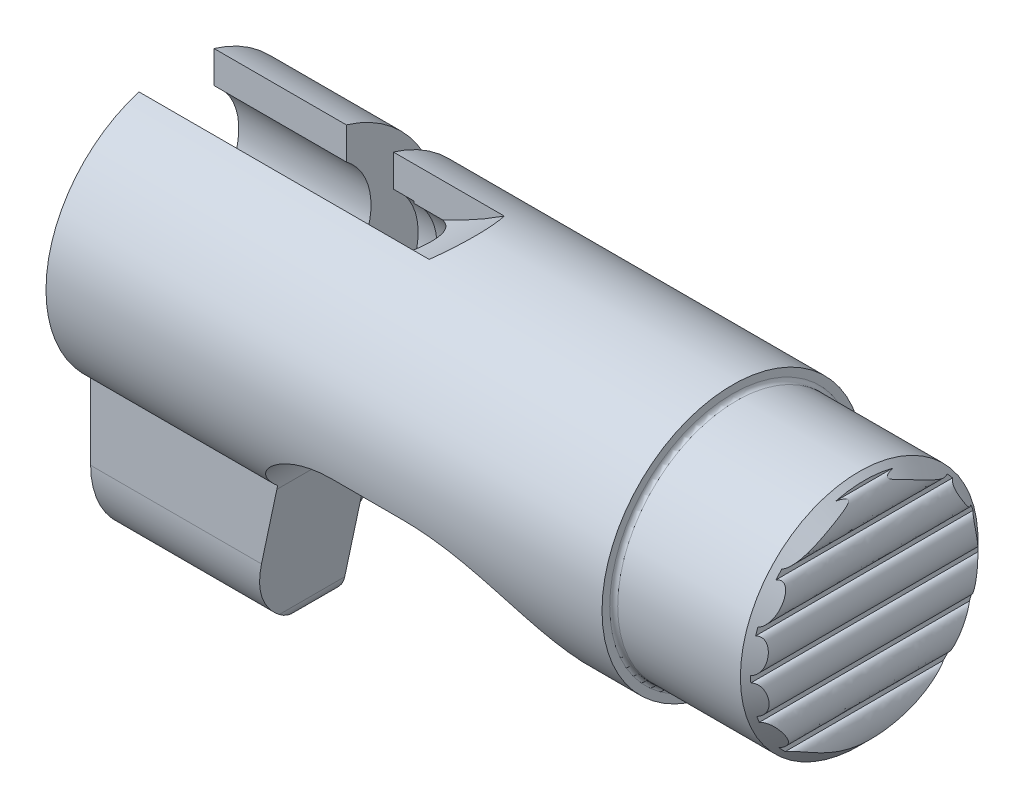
ISO-10303-21;
HEADER;
FILE_DESCRIPTION(('STEP AP214'),'2;1');
FILE_NAME('part.step','',(''),(''),'','','');
FILE_SCHEMA(('AUTOMOTIVE_DESIGN { 1 0 10303 214 1 1 1 1 }'));
ENDSEC;
DATA;
#1=APPLICATION_CONTEXT('core data for automotive mechanical design processes');
#2=APPLICATION_PROTOCOL_DEFINITION('international standard','automotive_design',2000,#1);
#3=PRODUCT_CONTEXT('',#1,'mechanical');
#4=PRODUCT('Part','Part','',(#3));
#5=PRODUCT_RELATED_PRODUCT_CATEGORY('part','',(#4));
#6=PRODUCT_DEFINITION_FORMATION('','',#4);
#7=PRODUCT_DEFINITION_CONTEXT('part definition',#1,'design');
#8=PRODUCT_DEFINITION('design','',#6,#7);
#9=PRODUCT_DEFINITION_SHAPE('','',#8);
#10=(LENGTH_UNIT() NAMED_UNIT(*) SI_UNIT(.MILLI.,.METRE.));
#11=(NAMED_UNIT(*) PLANE_ANGLE_UNIT() SI_UNIT($,.RADIAN.));
#12=(NAMED_UNIT(*) SI_UNIT($,.STERADIAN.) SOLID_ANGLE_UNIT());
#13=UNCERTAINTY_MEASURE_WITH_UNIT(LENGTH_MEASURE(1.E-05),#10,'distance_accuracy_value','');
#14=(GEOMETRIC_REPRESENTATION_CONTEXT(3) GLOBAL_UNCERTAINTY_ASSIGNED_CONTEXT((#13)) GLOBAL_UNIT_ASSIGNED_CONTEXT((#10,
#11,#12)) REPRESENTATION_CONTEXT('',''));
#15=CARTESIAN_POINT('',(0.,0.,0.));
#16=DIRECTION('',(0.,0.,1.));
#17=DIRECTION('',(1.,0.,0.));
#18=AXIS2_PLACEMENT_3D('',#15,#16,#17);
#19=CARTESIAN_POINT('',(0.,0.,0.));
#20=DIRECTION('',(1.,0.,0.));
#21=DIRECTION('',(0.,0.,-1.));
#22=AXIS2_PLACEMENT_3D('',#19,#20,#21);
#23=PLANE('',#22);
#24=CARTESIAN_POINT('',(0.,1.3715999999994,0.));
#25=DIRECTION('',(-1.,0.,0.));
#26=DIRECTION('',(0.,0.,1.));
#27=AXIS2_PLACEMENT_3D('',#24,#25,#26);
#28=CIRCLE('',#27,1.9812);
#29=CARTESIAN_POINT('',(0.,2.95273724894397,-1.1938));
#30=VERTEX_POINT('',#29);
#31=CARTESIAN_POINT('',(0.,2.95273724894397,1.1938));
#32=VERTEX_POINT('',#31);
#33=EDGE_CURVE('E256',#30,#32,#28,.T.);
#34=ORIENTED_EDGE('',*,*,#33,.F.);
#35=DIRECTION('',(0.,1.,0.));
#36=VECTOR('',#35,1.);
#37=CARTESIAN_POINT('',(0.,0.,-1.1938));
#38=LINE('',#37,#36);
#39=CARTESIAN_POINT('',(0.,3.97402892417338,-1.1938));
#40=VERTEX_POINT('',#39);
#41=EDGE_CURVE('E283',#30,#40,#38,.T.);
#42=ORIENTED_EDGE('',*,*,#41,.T.);
#43=CARTESIAN_POINT('',(0.,0.,0.));
#44=DIRECTION('',(-1.,0.,0.));
#45=DIRECTION('',(0.,0.,1.));
#46=AXIS2_PLACEMENT_3D('',#43,#44,#45);
#47=CIRCLE('',#46,4.1494655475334);
#48=CARTESIAN_POINT('',(0.,-3.1244894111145,-2.7305));
#49=VERTEX_POINT('',#48);
#50=EDGE_CURVE('E471',#40,#49,#47,.T.);
#51=ORIENTED_EDGE('',*,*,#50,.T.);
#52=DIRECTION('',(0.,1.,0.));
#53=VECTOR('',#52,1.);
#54=CARTESIAN_POINT('',(0.,-19.0398849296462,-2.7305));
#55=LINE('',#54,#53);
#56=CARTESIAN_POINT('',(0.,-5.5406344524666,-2.7305));
#57=VERTEX_POINT('',#56);
#58=EDGE_CURVE('E770',#57,#49,#55,.T.);
#59=ORIENTED_EDGE('',*,*,#58,.F.);
#60=CARTESIAN_POINT('',(0.,-5.5406344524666,0.));
#61=DIRECTION('',(-1.,0.,0.));
#62=DIRECTION('',(0.,0.,1.));
#63=AXIS2_PLACEMENT_3D('',#60,#61,#62);
#64=CIRCLE('',#63,2.7305);
#65=CARTESIAN_POINT('',(0.,-5.5406344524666,2.7305));
#66=VERTEX_POINT('',#65);
#67=EDGE_CURVE('E388',#57,#66,#64,.T.);
#68=ORIENTED_EDGE('',*,*,#67,.T.);
#69=DIRECTION('',(0.,1.,0.));
#70=VECTOR('',#69,1.);
#71=CARTESIAN_POINT('',(0.,-19.0398849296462,2.7305));
#72=LINE('',#71,#70);
#73=CARTESIAN_POINT('',(0.,-3.1244894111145,2.7305));
#74=VERTEX_POINT('',#73);
#75=EDGE_CURVE('E820',#66,#74,#72,.T.);
#76=ORIENTED_EDGE('',*,*,#75,.T.);
#77=CARTESIAN_POINT('',(0.,3.97402892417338,1.1938));
#78=VERTEX_POINT('',#77);
#79=EDGE_CURVE('E279',#74,#78,#47,.T.);
#80=ORIENTED_EDGE('',*,*,#79,.T.);
#81=DIRECTION('',(0.,1.,0.));
#82=VECTOR('',#81,1.);
#83=CARTESIAN_POINT('',(0.,0.,1.1938));
#84=LINE('',#83,#82);
#85=EDGE_CURVE('E271',#32,#78,#84,.T.);
#86=ORIENTED_EDGE('',*,*,#85,.F.);
#87=EDGE_LOOP('',(#34,#42,#51,#59,#68,#76,#80,#86));
#88=FACE_BOUND('',#87,.T.);
#89=ADVANCED_FACE('F36',(#88),#23,.F.);
#90=CARTESIAN_POINT('',(1.0159999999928,16.51,-1.1938));
#91=DIRECTION('',(0.,0.,-1.));
#92=DIRECTION('',(-1.,0.,0.));
#93=AXIS2_PLACEMENT_3D('',#90,#91,#92);
#94=PLANE('',#93);
#95=DIRECTION('',(1.,0.,0.));
#96=VECTOR('',#95,1.);
#97=CARTESIAN_POINT('',(0.,2.95273724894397,-1.1938));
#98=LINE('',#97,#96);
#99=CARTESIAN_POINT('',(4.2037,2.95273724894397,-1.1938));
#100=VERTEX_POINT('',#99);
#101=EDGE_CURVE('E263',#100,#30,#98,.F.);
#102=ORIENTED_EDGE('',*,*,#101,.F.);
#103=DIRECTION('',(0.,-1.,0.));
#104=VECTOR('',#103,1.);
#105=CARTESIAN_POINT('',(4.2037,16.51,-1.1938));
#106=LINE('',#105,#104);
#107=CARTESIAN_POINT('',(4.2037,3.97402892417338,-1.1938));
#108=VERTEX_POINT('',#107);
#109=EDGE_CURVE('E335',#108,#100,#106,.T.);
#110=ORIENTED_EDGE('',*,*,#109,.F.);
#111=DIRECTION('',(-1.,0.,0.));
#112=VECTOR('',#111,1.);
#113=CARTESIAN_POINT('',(0.,3.97402892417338,-1.1938));
#114=LINE('',#113,#112);
#115=EDGE_CURVE('E292',#40,#108,#114,.F.);
#116=ORIENTED_EDGE('',*,*,#115,.F.);
#117=ORIENTED_EDGE('',*,*,#41,.F.);
#118=EDGE_LOOP('',(#102,#110,#116,#117));
#119=FACE_BOUND('',#118,.T.);
#120=ADVANCED_FACE('F449',(#119),#94,.F.);
#121=CARTESIAN_POINT('',(0.,1.3715999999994,0.));
#122=DIRECTION('',(-1.,0.,0.));
#123=DIRECTION('',(0.,0.,1.));
#124=AXIS2_PLACEMENT_3D('',#121,#122,#123);
#125=CYLINDRICAL_SURFACE('',#124,1.93039999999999);
#126=CARTESIAN_POINT('',(17.526,1.3715999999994,0.));
#127=DIRECTION('',(-1.,0.,0.));
#128=DIRECTION('',(0.,0.,1.));
#129=AXIS2_PLACEMENT_3D('',#126,#127,#128);
#130=CIRCLE('',#129,1.9304);
#131=CARTESIAN_POINT('',(17.526,1.3715999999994,1.9304));
#132=VERTEX_POINT('',#131);
#133=EDGE_CURVE('E303',#132,#132,#130,.T.);
#134=ORIENTED_EDGE('',*,*,#133,.F.);
#135=EDGE_LOOP('',(#134));
#136=FACE_BOUND('',#135,.T.);
#137=CARTESIAN_POINT('',(6.35,1.3715999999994,0.));
#138=DIRECTION('',(-1.,0.,0.));
#139=DIRECTION('',(0.,0.,1.));
#140=AXIS2_PLACEMENT_3D('',#137,#138,#139);
#141=CIRCLE('',#140,1.93039999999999);
#142=CARTESIAN_POINT('',(6.35,2.88859891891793,1.1938));
#143=VERTEX_POINT('',#142);
#144=CARTESIAN_POINT('',(6.35,2.88859891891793,-1.1938));
#145=VERTEX_POINT('',#144);
#146=EDGE_CURVE('E274',#143,#145,#141,.F.);
#147=ORIENTED_EDGE('',*,*,#146,.F.);
#148=DIRECTION('',(-1.,0.,0.));
#149=VECTOR('',#148,1.);
#150=CARTESIAN_POINT('',(0.,2.88859891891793,1.1938));
#151=LINE('',#150,#149);
#152=CARTESIAN_POINT('',(7.26400997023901,2.88859891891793,1.1938));
#153=VERTEX_POINT('',#152);
#154=EDGE_CURVE('E331',#153,#143,#151,.T.);
#155=ORIENTED_EDGE('',*,*,#154,.F.);
#156=CARTESIAN_POINT('',(7.26400997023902,2.88859891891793,1.1938));
#157=CARTESIAN_POINT('',(7.30799071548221,2.90876972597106,1.16815106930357));
#158=CARTESIAN_POINT('',(7.35129942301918,2.92889558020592,1.14125463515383));
#159=CARTESIAN_POINT('',(7.43631738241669,2.96888062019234,1.08459929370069));
#160=CARTESIAN_POINT('',(7.47802206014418,2.98873895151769,1.05483294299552));
#161=CARTESIAN_POINT('',(7.56000768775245,3.02822464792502,0.991688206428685));
#162=CARTESIAN_POINT('',(7.60025387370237,3.04784282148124,0.958258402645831));
#163=CARTESIAN_POINT('',(7.67798598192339,3.08614011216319,0.887918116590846));
#164=CARTESIAN_POINT('',(7.71547490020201,3.10482024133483,0.851011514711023));
#165=CARTESIAN_POINT('',(7.7969066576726,3.14579024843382,0.762676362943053));
#166=CARTESIAN_POINT('',(7.83978535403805,3.16765830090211,0.710046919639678));
#167=CARTESIAN_POINT('',(7.91782279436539,3.20785887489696,0.598405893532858));
#168=CARTESIAN_POINT('',(7.9530186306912,3.22620832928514,0.539427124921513));
#169=CARTESIAN_POINT('',(8.00735601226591,3.25474107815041,0.427614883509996));
#170=CARTESIAN_POINT('',(8.02829898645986,3.26582295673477,0.375897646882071));
#171=CARTESIAN_POINT('',(8.06233511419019,3.28389953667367,0.269209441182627));
#172=CARTESIAN_POINT('',(8.07543026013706,3.29089527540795,0.214239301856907));
#173=CARTESIAN_POINT('',(8.09267549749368,3.30011877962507,0.102152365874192));
#174=CARTESIAN_POINT('',(8.09677270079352,3.30231835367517,0.0450248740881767));
#175=CARTESIAN_POINT('',(8.09544503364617,3.30160665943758,-0.0690875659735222));
#176=CARTESIAN_POINT('',(8.09002029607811,3.29869546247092,-0.126072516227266));
#177=CARTESIAN_POINT('',(8.07113110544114,3.28860003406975,-0.232720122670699));
#178=CARTESIAN_POINT('',(8.05846392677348,3.28183979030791,-0.282569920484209));
#179=CARTESIAN_POINT('',(8.02668066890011,3.26496790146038,-0.379506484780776));
#180=CARTESIAN_POINT('',(8.00756651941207,3.25485725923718,-0.426594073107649));
#181=CARTESIAN_POINT('',(7.95346641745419,3.22643596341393,-0.539295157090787));
#182=CARTESIAN_POINT('',(7.91526571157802,3.20651868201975,-0.602954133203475));
#183=CARTESIAN_POINT('',(7.83004600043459,3.1626677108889,-0.722941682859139));
#184=CARTESIAN_POINT('',(7.78297177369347,3.13870897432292,-0.779220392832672));
#185=CARTESIAN_POINT('',(7.69796438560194,3.09608643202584,-0.868463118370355));
#186=CARTESIAN_POINT('',(7.66163504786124,3.07804251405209,-0.903295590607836));
#187=CARTESIAN_POINT('',(7.5865243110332,3.04114121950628,-0.969806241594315));
#188=CARTESIAN_POINT('',(7.54774083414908,3.02228315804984,-1.00148168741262));
#189=CARTESIAN_POINT('',(7.46894096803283,2.98440858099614,-1.0613800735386));
#190=CARTESIAN_POINT('',(7.42895928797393,2.96540101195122,-1.08965485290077));
#191=CARTESIAN_POINT('',(7.34752540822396,2.92714253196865,-1.14359657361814));
#192=CARTESIAN_POINT('',(7.30607660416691,2.90789224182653,-1.16926906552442));
#193=CARTESIAN_POINT('',(7.26400997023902,2.88859891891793,-1.1938));
#194=B_SPLINE_CURVE_WITH_KNOTS('',3,(#156,#157,#158,#159,#160,#161,#162,#163,#164,#165,#166,
#167,#168,#169,#170,#171,#172,#173,#174,#175,#176,#177,#178,#179,#180,#181,#182,#183,#184,#185,
#186,#187,#188,#189,#190,#191,#192,#193),.UNSPECIFIED.,.F.,.F.,(4,2,2,2,2,2,2,2,2,2,2,2,2,2,2,2,
2,2,4),(0.,0.16431330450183,0.32906486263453,0.49653001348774,0.663810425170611,
0.877138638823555,1.08941294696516,1.25940143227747,1.42934674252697,1.60028831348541,
1.77122749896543,1.92621905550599,2.08116426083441,2.31047140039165,2.54125571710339,
2.70150050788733,2.8618828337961,3.01938127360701,3.1765363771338),.UNSPECIFIED.);
#195=CARTESIAN_POINT('',(7.26400997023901,2.88859891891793,-1.1938));
#196=VERTEX_POINT('',#195);
#197=EDGE_CURVE('E323',#153,#196,#194,.T.);
#198=ORIENTED_EDGE('',*,*,#197,.T.);
#199=DIRECTION('',(-1.,0.,0.));
#200=VECTOR('',#199,1.);
#201=CARTESIAN_POINT('',(0.,2.88859891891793,-1.1938));
#202=LINE('',#201,#200);
#203=EDGE_CURVE('E330',#196,#145,#202,.T.);
#204=ORIENTED_EDGE('',*,*,#203,.T.);
#205=EDGE_LOOP('',(#147,#155,#198,#204));
#206=FACE_BOUND('',#205,.T.);
#207=ADVANCED_FACE('F318',(#136,#206),#125,.F.);
#208=DIRECTION('',(1.,0.,0.));
#209=VECTOR('',#208,1.);
#210=CARTESIAN_POINT('',(0.,2.95273724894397,-1.1938));
#211=LINE('',#210,#209);
#212=CARTESIAN_POINT('',(6.35,2.95273724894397,-1.1938));
#213=VERTEX_POINT('',#212);
#214=CARTESIAN_POINT('',(5.7023,2.95273724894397,-1.1938));
#215=VERTEX_POINT('',#214);
#216=EDGE_CURVE('E275',#213,#215,#211,.F.);
#217=ORIENTED_EDGE('',*,*,#216,.F.);
#218=DIRECTION('',(0.,1.,0.));
#219=VECTOR('',#218,1.);
#220=CARTESIAN_POINT('',(6.35,16.51,-1.1938));
#221=LINE('',#220,#219);
#222=EDGE_CURVE('E710',#145,#213,#221,.T.);
#223=ORIENTED_EDGE('',*,*,#222,.F.);
#224=ORIENTED_EDGE('',*,*,#203,.F.);
#225=CARTESIAN_POINT('',(1.0159999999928,16.51,-1.1938));
#226=DIRECTION('',(0.,0.,1.));
#227=DIRECTION('',(-1.,0.,0.));
#228=AXIS2_PLACEMENT_3D('',#225,#226,#227);
#229=CIRCLE('',#228,14.986);
#230=CARTESIAN_POINT('',(9.2275543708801,3.97402892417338,-1.1938));
#231=VERTEX_POINT('',#230);
#232=EDGE_CURVE('E281',#196,#231,#229,.T.);
#233=ORIENTED_EDGE('',*,*,#232,.T.);
#234=CARTESIAN_POINT('',(5.7023,3.97402892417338,-1.1938));
#235=VERTEX_POINT('',#234);
#236=EDGE_CURVE('E291',#235,#231,#114,.F.);
#237=ORIENTED_EDGE('',*,*,#236,.F.);
#238=DIRECTION('',(0.,-1.,0.));
#239=VECTOR('',#238,1.);
#240=CARTESIAN_POINT('',(5.7023,16.51,-1.1938));
#241=LINE('',#240,#239);
#242=EDGE_CURVE('E338',#235,#215,#241,.T.);
#243=ORIENTED_EDGE('',*,*,#242,.T.);
#244=EDGE_LOOP('',(#217,#223,#224,#233,#237,#243));
#245=FACE_BOUND('',#244,.T.);
#246=ADVANCED_FACE('F454',(#245),#94,.F.);
#247=CARTESIAN_POINT('',(1.0159999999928,16.51,1.1938));
#248=DIRECTION('',(0.,0.,-1.));
#249=DIRECTION('',(-1.,0.,0.));
#250=AXIS2_PLACEMENT_3D('',#247,#248,#249);
#251=PLANE('',#250);
#252=DIRECTION('',(0.,1.,0.));
#253=VECTOR('',#252,1.);
#254=CARTESIAN_POINT('',(6.35,16.51,1.1938));
#255=LINE('',#254,#253);
#256=CARTESIAN_POINT('',(6.35,2.95273724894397,1.1938));
#257=VERTEX_POINT('',#256);
#258=EDGE_CURVE('E11',#143,#257,#255,.T.);
#259=ORIENTED_EDGE('',*,*,#258,.T.);
#260=DIRECTION('',(1.,0.,0.));
#261=VECTOR('',#260,1.);
#262=CARTESIAN_POINT('',(0.,2.95273724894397,1.1938));
#263=LINE('',#262,#261);
#264=EDGE_CURVE('E260',#257,#32,#263,.F.);
#265=ORIENTED_EDGE('',*,*,#264,.T.);
#266=ORIENTED_EDGE('',*,*,#85,.T.);
#267=DIRECTION('',(-1.,0.,0.));
#268=VECTOR('',#267,1.);
#269=CARTESIAN_POINT('',(0.,3.97402892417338,1.1938));
#270=LINE('',#269,#268);
#271=CARTESIAN_POINT('',(9.2275543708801,3.97402892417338,1.1938));
#272=VERTEX_POINT('',#271);
#273=EDGE_CURVE('E280',#78,#272,#270,.F.);
#274=ORIENTED_EDGE('',*,*,#273,.T.);
#275=CARTESIAN_POINT('',(1.0159999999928,16.51,1.1938));
#276=DIRECTION('',(0.,0.,1.));
#277=DIRECTION('',(-1.,0.,0.));
#278=AXIS2_PLACEMENT_3D('',#275,#276,#277);
#279=CIRCLE('',#278,14.986);
#280=EDGE_CURVE('E286',#153,#272,#279,.T.);
#281=ORIENTED_EDGE('',*,*,#280,.F.);
#282=ORIENTED_EDGE('',*,*,#154,.T.);
#283=EDGE_LOOP('',(#259,#265,#266,#274,#281,#282));
#284=FACE_BOUND('',#283,.T.);
#285=ADVANCED_FACE('F270',(#284),#251,.T.);
#286=CARTESIAN_POINT('',(5.7023,4.699,-5.96899999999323));
#287=DIRECTION('',(-1.,0.,0.));
#288=DIRECTION('',(0.,0.,1.));
#289=AXIS2_PLACEMENT_3D('',#286,#287,#288);
#290=CYLINDRICAL_SURFACE('',#289,7.112);
#291=DIRECTION('',(1.,0.,0.));
#292=VECTOR('',#291,1.);
#293=CARTESIAN_POINT('',(3.175,-0.357277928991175,-0.967540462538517));
#294=LINE('',#293,#292);
#295=CARTESIAN_POINT('',(5.7023,-0.357277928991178,-0.96754046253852));
#296=VERTEX_POINT('',#295);
#297=CARTESIAN_POINT('',(4.2037,-0.357277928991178,-0.96754046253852));
#298=VERTEX_POINT('',#297);
#299=EDGE_CURVE('E52',#296,#298,#294,.F.);
#300=ORIENTED_EDGE('',*,*,#299,.F.);
#301=CARTESIAN_POINT('',(5.7023,4.699,-5.96899999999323));
#302=DIRECTION('',(-1.,0.,0.));
#303=DIRECTION('',(0.,0.,-1.));
#304=AXIS2_PLACEMENT_3D('',#301,#302,#303);
#305=CIRCLE('',#304,7.112);
#306=CARTESIAN_POINT('',(5.7023,-1.35578235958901,-2.23802766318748));
#307=VERTEX_POINT('',#306);
#308=EDGE_CURVE('E730',#307,#296,#305,.T.);
#309=ORIENTED_EDGE('',*,*,#308,.F.);
#310=CARTESIAN_POINT('',(5.7023,-1.35578235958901,-2.23802766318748));
#311=CARTESIAN_POINT('',(5.63739541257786,-1.40414951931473,-2.31644595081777));
#312=CARTESIAN_POINT('',(5.5773873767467,-1.45265340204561,-2.3986419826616));
#313=CARTESIAN_POINT('',(5.46643593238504,-1.54857044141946,-2.56932038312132));
#314=CARTESIAN_POINT('',(5.41547773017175,-1.5959852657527,-2.65779215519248));
#315=CARTESIAN_POINT('',(5.32241937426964,-1.68780715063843,-2.83859949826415));
#316=CARTESIAN_POINT('',(5.28019357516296,-1.7322495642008,-2.93085339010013));
#317=CARTESIAN_POINT('',(5.20273706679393,-1.8180758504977,-3.11961359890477));
#318=CARTESIAN_POINT('',(5.16750639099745,-1.85945970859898,-3.21611993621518));
#319=CARTESIAN_POINT('',(5.11865000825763,-1.91953154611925,-3.36542142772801));
#320=CARTESIAN_POINT('',(5.10277287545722,-1.9395761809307,-3.41695563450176));
#321=CARTESIAN_POINT('',(5.07251020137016,-1.97867951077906,-3.5210933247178));
#322=CARTESIAN_POINT('',(5.05813114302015,-1.99773375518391,-3.5737003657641));
#323=CARTESIAN_POINT('',(5.04447853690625,-2.01621841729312,-3.62669651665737));
#324=B_SPLINE_CURVE_WITH_KNOTS('',3,(#310,#311,#312,#313,#314,#315,#316,#317,#318,#319,#320,
#321,#322,#323),.UNSPECIFIED.,.F.,.F.,(4,2,2,2,2,2,4),(0.,0.337744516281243,0.674931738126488,
1.00686528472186,1.33880041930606,1.51135749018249,1.68463273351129),.UNSPECIFIED.);
#325=CARTESIAN_POINT('',(5.04447853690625,-2.01621841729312,-3.62669651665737));
#326=VERTEX_POINT('',#325);
#327=EDGE_CURVE('E410',#307,#326,#324,.T.);
#328=ORIENTED_EDGE('',*,*,#327,.T.);
#329=DIRECTION('',(-1.,0.,0.));
#330=VECTOR('',#329,1.);
#331=CARTESIAN_POINT('',(4.953,-2.01621841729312,-3.62669651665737));
#332=LINE('',#331,#330);
#333=CARTESIAN_POINT('',(4.2037,-2.01621841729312,-3.62669651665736));
#334=VERTEX_POINT('',#333);
#335=EDGE_CURVE('E736',#334,#326,#332,.F.);
#336=ORIENTED_EDGE('',*,*,#335,.F.);
#337=CARTESIAN_POINT('',(4.2037,4.699,-5.96899999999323));
#338=DIRECTION('',(-1.,0.,0.));
#339=DIRECTION('',(0.,0.,-1.));
#340=AXIS2_PLACEMENT_3D('',#337,#338,#339);
#341=CIRCLE('',#340,7.112);
#342=EDGE_CURVE('E734',#334,#298,#341,.T.);
#343=ORIENTED_EDGE('',*,*,#342,.T.);
#344=EDGE_LOOP('',(#300,#309,#328,#336,#343));
#345=FACE_BOUND('',#344,.T.);
#346=ADVANCED_FACE('F425',(#345),#290,.F.);
#347=CARTESIAN_POINT('',(5.7023,4.699,-5.96899999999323));
#348=DIRECTION('',(1.,0.,0.));
#349=DIRECTION('',(0.,0.,-1.));
#350=AXIS2_PLACEMENT_3D('',#347,#348,#349);
#351=PLANE('',#350);
#352=CARTESIAN_POINT('',(5.7023,1.3715999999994,0.));
#353=DIRECTION('',(1.,0.,0.));
#354=DIRECTION('',(0.,0.,-1.));
#355=AXIS2_PLACEMENT_3D('',#352,#353,#354);
#356=CIRCLE('',#355,1.9812);
#357=EDGE_CURVE('E714',#215,#296,#356,.F.);
#358=ORIENTED_EDGE('',*,*,#357,.F.);
#359=ORIENTED_EDGE('',*,*,#242,.F.);
#360=CARTESIAN_POINT('',(5.7023,0.,0.));
#361=DIRECTION('',(1.,0.,0.));
#362=DIRECTION('',(0.,0.,-1.));
#363=AXIS2_PLACEMENT_3D('',#360,#361,#362);
#364=CIRCLE('',#363,4.1494655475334);
#365=CARTESIAN_POINT('',(5.7023,-1.35578235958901,-3.92172392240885));
#366=VERTEX_POINT('',#365);
#367=EDGE_CURVE('E727',#366,#235,#364,.T.);
#368=ORIENTED_EDGE('',*,*,#367,.F.);
#369=DIRECTION('',(0.,0.,1.));
#370=VECTOR('',#369,1.);
#371=CARTESIAN_POINT('',(5.7023,-1.35578235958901,-4.1494655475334));
#372=LINE('',#371,#370);
#373=EDGE_CURVE('E347',#366,#307,#372,.T.);
#374=ORIENTED_EDGE('',*,*,#373,.T.);
#375=ORIENTED_EDGE('',*,*,#308,.T.);
#376=EDGE_LOOP('',(#358,#359,#368,#374,#375));
#377=FACE_BOUND('',#376,.T.);
#378=ADVANCED_FACE('F433',(#377),#351,.F.);
#379=CARTESIAN_POINT('',(4.2037,4.699,-5.96899999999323));
#380=DIRECTION('',(1.,0.,0.));
#381=DIRECTION('',(0.,0.,-1.));
#382=AXIS2_PLACEMENT_3D('',#379,#380,#381);
#383=PLANE('',#382);
#384=ORIENTED_EDGE('',*,*,#109,.T.);
#385=CARTESIAN_POINT('',(4.2037,1.3715999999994,0.));
#386=DIRECTION('',(1.,0.,0.));
#387=DIRECTION('',(0.,0.,-1.));
#388=AXIS2_PLACEMENT_3D('',#385,#386,#387);
#389=CIRCLE('',#388,1.9812);
#390=EDGE_CURVE('E45',#100,#298,#389,.F.);
#391=ORIENTED_EDGE('',*,*,#390,.T.);
#392=ORIENTED_EDGE('',*,*,#342,.F.);
#393=CARTESIAN_POINT('',(4.2037,0.,0.));
#394=DIRECTION('',(1.,0.,0.));
#395=DIRECTION('',(0.,0.,-1.));
#396=AXIS2_PLACEMENT_3D('',#393,#394,#395);
#397=CIRCLE('',#396,4.1494655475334);
#398=EDGE_CURVE('E740',#334,#108,#397,.T.);
#399=ORIENTED_EDGE('',*,*,#398,.T.);
#400=EDGE_LOOP('',(#384,#391,#392,#399));
#401=FACE_BOUND('',#400,.T.);
#402=ADVANCED_FACE('F436',(#401),#383,.T.);
#403=CARTESIAN_POINT('',(21.8694,3.61390353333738,0.));
#404=DIRECTION('',(-1.,0.,0.));
#405=DIRECTION('',(0.,0.,1.));
#406=AXIS2_PLACEMENT_3D('',#403,#404,#405);
#407=PLANE('',#406);
#408=CARTESIAN_POINT('',(21.8694,0.,0.));
#409=DIRECTION('',(-1.,0.,0.));
#410=DIRECTION('',(0.,0.,1.));
#411=AXIS2_PLACEMENT_3D('',#408,#409,#410);
#412=CIRCLE('',#411,3.61390353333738);
#413=CARTESIAN_POINT('',(21.8694,-1.37870353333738,3.3405800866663));
#414=VERTEX_POINT('',#413);
#415=CARTESIAN_POINT('',(21.8694,-1.17550353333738,3.41738060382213));
#416=VERTEX_POINT('',#415);
#417=EDGE_CURVE('E784',#414,#416,#412,.T.);
#418=ORIENTED_EDGE('',*,*,#417,.F.);
#419=DIRECTION('',(0.,0.,-1.));
#420=VECTOR('',#419,1.);
#421=CARTESIAN_POINT('',(21.8694,-1.37870353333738,4.1504655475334));
#422=LINE('',#421,#420);
#423=CARTESIAN_POINT('',(21.8694,-1.37870353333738,-3.3405800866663));
#424=VERTEX_POINT('',#423);
#425=EDGE_CURVE('E705',#414,#424,#422,.T.);
#426=ORIENTED_EDGE('',*,*,#425,.T.);
#427=CARTESIAN_POINT('',(21.8694,-1.17550353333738,-3.41738060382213));
#428=VERTEX_POINT('',#427);
#429=EDGE_CURVE('E648',#428,#424,#412,.T.);
#430=ORIENTED_EDGE('',*,*,#429,.F.);
#431=DIRECTION('',(0.,0.,-1.));
#432=VECTOR('',#431,1.);
#433=CARTESIAN_POINT('',(21.8694,-1.17550353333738,4.1504655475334));
#434=LINE('',#433,#432);
#435=EDGE_CURVE('E689',#416,#428,#434,.T.);
#436=ORIENTED_EDGE('',*,*,#435,.F.);
#437=EDGE_LOOP('',(#418,#426,#430,#436));
#438=FACE_BOUND('',#437,.T.);
#439=ADVANCED_FACE('F439',(#438),#407,.F.);
#440=CARTESIAN_POINT('',(21.8694,-0.15950353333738,3.61038188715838));
#441=VERTEX_POINT('',#440);
#442=CARTESIAN_POINT('',(21.8694,0.0436964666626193,3.61363935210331));
#443=VERTEX_POINT('',#442);
#444=EDGE_CURVE('E686',#441,#443,#412,.T.);
#445=ORIENTED_EDGE('',*,*,#444,.F.);
#446=DIRECTION('',(0.,0.,-1.));
#447=VECTOR('',#446,1.);
#448=CARTESIAN_POINT('',(21.8694,-0.15950353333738,4.1504655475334));
#449=LINE('',#448,#447);
#450=CARTESIAN_POINT('',(21.8694,-0.15950353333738,-3.61038188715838));
#451=VERTEX_POINT('',#450);
#452=EDGE_CURVE('E685',#441,#451,#449,.T.);
#453=ORIENTED_EDGE('',*,*,#452,.T.);
#454=CARTESIAN_POINT('',(21.8694,0.0436964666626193,-3.61363935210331));
#455=VERTEX_POINT('',#454);
#456=EDGE_CURVE('E645',#455,#451,#412,.T.);
#457=ORIENTED_EDGE('',*,*,#456,.F.);
#458=DIRECTION('',(0.,0.,-1.));
#459=VECTOR('',#458,1.);
#460=CARTESIAN_POINT('',(21.8694,0.0436964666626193,4.1504655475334));
#461=LINE('',#460,#459);
#462=EDGE_CURVE('E675',#443,#455,#461,.T.);
#463=ORIENTED_EDGE('',*,*,#462,.F.);
#464=EDGE_LOOP('',(#445,#453,#457,#463));
#465=FACE_BOUND('',#464,.T.);
#466=ADVANCED_FACE('F444',(#465),#407,.F.);
#467=CARTESIAN_POINT('',(21.8694,1.05969646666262,3.45504589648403));
#468=VERTEX_POINT('',#467);
#469=CARTESIAN_POINT('',(21.8694,1.26289646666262,3.38605836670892));
#470=VERTEX_POINT('',#469);
#471=EDGE_CURVE('E640',#468,#470,#412,.T.);
#472=ORIENTED_EDGE('',*,*,#471,.F.);
#473=DIRECTION('',(0.,0.,-1.));
#474=VECTOR('',#473,1.);
#475=CARTESIAN_POINT('',(21.8694,1.05969646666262,4.1504655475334));
#476=LINE('',#475,#474);
#477=CARTESIAN_POINT('',(21.8694,1.05969646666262,-3.45504589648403));
#478=VERTEX_POINT('',#477);
#479=EDGE_CURVE('E644',#468,#478,#476,.T.);
#480=ORIENTED_EDGE('',*,*,#479,.T.);
#481=CARTESIAN_POINT('',(21.8694,1.26289646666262,-3.38605836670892));
#482=VERTEX_POINT('',#481);
#483=EDGE_CURVE('E642',#482,#478,#412,.T.);
#484=ORIENTED_EDGE('',*,*,#483,.F.);
#485=DIRECTION('',(0.,0.,-1.));
#486=VECTOR('',#485,1.);
#487=CARTESIAN_POINT('',(21.8694,1.26289646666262,4.1504655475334));
#488=LINE('',#487,#486);
#489=EDGE_CURVE('E620',#470,#482,#488,.T.);
#490=ORIENTED_EDGE('',*,*,#489,.F.);
#491=EDGE_LOOP('',(#472,#480,#484,#490));
#492=FACE_BOUND('',#491,.T.);
#493=ADVANCED_FACE('F638',(#492),#407,.F.);
#494=CARTESIAN_POINT('',(21.8694,3.49809646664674,0.907535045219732));
#495=VERTEX_POINT('',#494);
#496=CARTESIAN_POINT('',(21.8694,3.49809646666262,-0.907535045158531));
#497=VERTEX_POINT('',#496);
#498=EDGE_CURVE('E646',#495,#497,#412,.T.);
#499=ORIENTED_EDGE('',*,*,#498,.F.);
#500=DIRECTION('',(0.,0.,-1.));
#501=VECTOR('',#500,1.);
#502=CARTESIAN_POINT('',(21.8694,3.49809646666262,4.1504655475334));
#503=LINE('',#502,#501);
#504=EDGE_CURVE('E658',#495,#497,#503,.T.);
#505=ORIENTED_EDGE('',*,*,#504,.T.);
#506=EDGE_LOOP('',(#499,#505));
#507=FACE_BOUND('',#506,.T.);
#508=ADVANCED_FACE('F657',(#507),#407,.F.);
#509=CARTESIAN_POINT('',(21.8694,2.48209646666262,-2.62668914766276));
#510=VERTEX_POINT('',#509);
#511=CARTESIAN_POINT('',(21.8694,2.27889646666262,-2.80480474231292));
#512=VERTEX_POINT('',#511);
#513=EDGE_CURVE('E633',#510,#512,#412,.T.);
#514=ORIENTED_EDGE('',*,*,#513,.F.);
#515=DIRECTION('',(0.,0.,-1.));
#516=VECTOR('',#515,1.);
#517=CARTESIAN_POINT('',(21.8694,2.48209646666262,4.1504655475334));
#518=LINE('',#517,#516);
#519=CARTESIAN_POINT('',(21.8694,2.48209646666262,2.62668914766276));
#520=VERTEX_POINT('',#519);
#521=EDGE_CURVE('E660',#520,#510,#518,.T.);
#522=ORIENTED_EDGE('',*,*,#521,.F.);
#523=CARTESIAN_POINT('',(21.8694,2.27889646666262,2.80480474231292));
#524=VERTEX_POINT('',#523);
#525=EDGE_CURVE('E635',#524,#520,#412,.T.);
#526=ORIENTED_EDGE('',*,*,#525,.F.);
#527=DIRECTION('',(0.,0.,-1.));
#528=VECTOR('',#527,1.);
#529=CARTESIAN_POINT('',(21.8694,2.27889646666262,4.1504655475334));
#530=LINE('',#529,#528);
#531=EDGE_CURVE('E603',#524,#512,#530,.T.);
#532=ORIENTED_EDGE('',*,*,#531,.T.);
#533=EDGE_LOOP('',(#514,#522,#526,#532));
#534=FACE_BOUND('',#533,.T.);
#535=ADVANCED_FACE('F515',(#534),#407,.F.);
#536=CARTESIAN_POINT('',(4.23513831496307,-7.5091344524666,10.5283));
#537=DIRECTION('',(0.,0.,-1.));
#538=DIRECTION('',(-1.,0.,0.));
#539=AXIS2_PLACEMENT_3D('',#536,#537,#538);
#540=CYLINDRICAL_SURFACE('',#539,0.762);
#541=DIRECTION('',(0.,0.,-1.));
#542=VECTOR('',#541,1.);
#543=CARTESIAN_POINT('',(4.98048678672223,-7.66756316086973,10.5283));
#544=LINE('',#543,#542);
#545=CARTESIAN_POINT('',(4.98048678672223,-7.66756316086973,1.71225130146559));
#546=VERTEX_POINT('',#545);
#547=CARTESIAN_POINT('',(4.98048678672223,-7.66756316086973,-0.3683));
#548=VERTEX_POINT('',#547);
#549=EDGE_CURVE('E356',#546,#548,#544,.T.);
#550=ORIENTED_EDGE('',*,*,#549,.F.);
#551=CARTESIAN_POINT('',(4.98048678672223,-7.66756316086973,1.71225130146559));
#552=CARTESIAN_POINT('',(4.97332494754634,-7.7011616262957,1.6705226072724));
#553=CARTESIAN_POINT('',(4.96413638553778,-7.73332332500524,1.62805136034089));
#554=CARTESIAN_POINT('',(4.94236505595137,-7.79468499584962,1.54196908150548));
#555=CARTESIAN_POINT('',(4.92978844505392,-7.82389020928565,1.49836024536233));
#556=CARTESIAN_POINT('',(4.90194501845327,-7.87922271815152,1.41043312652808));
#557=CARTESIAN_POINT('',(4.88669306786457,-7.9053657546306,1.36611993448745));
#558=CARTESIAN_POINT('',(4.85392775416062,-7.95480672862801,1.27671974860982));
#559=CARTESIAN_POINT('',(4.83641295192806,-7.97810283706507,1.23163227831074));
#560=CARTESIAN_POINT('',(4.78998468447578,-8.03323247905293,1.11733505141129));
#561=CARTESIAN_POINT('',(4.75986600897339,-8.0632382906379,1.04772684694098));
#562=CARTESIAN_POINT('',(4.69650534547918,-8.11700875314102,0.907507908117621));
#563=CARTESIAN_POINT('',(4.66326086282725,-8.14076836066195,0.836896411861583));
#564=CARTESIAN_POINT('',(4.56009437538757,-8.20304824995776,0.623795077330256));
#565=CARTESIAN_POINT('',(4.48680696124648,-8.23249534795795,0.480195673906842));
#566=CARTESIAN_POINT('',(4.35520804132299,-8.26386157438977,0.227339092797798));
#567=CARTESIAN_POINT('',(4.29761481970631,-8.27075015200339,0.118267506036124));
#568=CARTESIAN_POINT('',(4.2383926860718,-8.2711292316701,0.0061604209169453));
#569=CARTESIAN_POINT('',(4.23676549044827,-8.27113444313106,0.00308018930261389));
#570=CARTESIAN_POINT('',(4.23513831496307,-8.2711344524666,0.));
#571=B_SPLINE_CURVE_WITH_KNOTS('',3,(#551,#552,#553,#554,#555,#556,#557,#558,#559,#560,#561,
#562,#563,#564,#565,#566,#567,#568,#569,#570),.UNSPECIFIED.,.F.,.F.,(4,2,2,2,2,2,2,2,2,4),(0.,
0.162014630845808,0.323736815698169,0.484587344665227,0.645540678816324,0.889859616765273,
1.13437522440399,1.62395975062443,1.99387011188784,2.00432096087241),.UNSPECIFIED.);
#572=CARTESIAN_POINT('',(4.23513831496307,-8.2711344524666,0.));
#573=VERTEX_POINT('',#572);
#574=EDGE_CURVE('E382',#546,#573,#571,.T.);
#575=ORIENTED_EDGE('',*,*,#574,.T.);
#576=CARTESIAN_POINT('',(4.42854334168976,-8.24618159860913,-0.368299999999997));
#577=CARTESIAN_POINT('',(4.39754135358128,-8.25431254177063,-0.308543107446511));
#578=CARTESIAN_POINT('',(4.36620508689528,-8.26044915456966,-0.248677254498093));
#579=CARTESIAN_POINT('',(4.30325251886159,-8.26874759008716,-0.128951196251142));
#580=CARTESIAN_POINT('',(4.27163680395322,-8.27091635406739,-0.0690911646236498));
#581=CARTESIAN_POINT('',(4.23839268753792,-8.27112923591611,-0.00616043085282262));
#582=CARTESIAN_POINT('',(4.23676549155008,-8.27113444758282,-0.00308019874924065));
#583=CARTESIAN_POINT('',(4.23513831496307,-8.2711344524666,0.));
#584=B_SPLINE_CURVE_WITH_KNOTS('',3,(#576,#577,#578,#579,#580,#581,#582,#583),.UNSPECIFIED.,.F.,
.F.,(4,2,2,4),(0.,0.203419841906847,0.40648348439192,0.416934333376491),.UNSPECIFIED.);
#585=CARTESIAN_POINT('',(4.42854334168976,-8.24618159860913,-0.3683));
#586=VERTEX_POINT('',#585);
#587=EDGE_CURVE('E361',#573,#586,#584,.F.);
#588=ORIENTED_EDGE('',*,*,#587,.T.);
#589=CARTESIAN_POINT('',(4.23513831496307,-7.5091344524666,-0.3683));
#590=DIRECTION('',(0.,0.,1.));
#591=DIRECTION('',(1.,0.,0.));
#592=AXIS2_PLACEMENT_3D('',#589,#590,#591);
#593=CIRCLE('',#592,0.762);
#594=EDGE_CURVE('E358',#548,#586,#593,.F.);
#595=ORIENTED_EDGE('',*,*,#594,.F.);
#596=EDGE_LOOP('',(#550,#575,#588,#595));
#597=FACE_BOUND('',#596,.T.);
#598=ADVANCED_FACE('F38',(#597),#540,.T.);
#599=CARTESIAN_POINT('',(2.80910774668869,-17.8830983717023,10.5283));
#600=DIRECTION('',(0.978147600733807,-0.207911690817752,0.));
#601=DIRECTION('',(0.207911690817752,0.978147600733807,0.));
#602=AXIS2_PLACEMENT_3D('',#599,#600,#601);
#603=PLANE('',#602);
#604=DIRECTION('',(-0.207911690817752,-0.978147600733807,0.));
#605=VECTOR('',#604,1.);
#606=CARTESIAN_POINT('',(2.80910774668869,-17.8830983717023,2.7305));
#607=LINE('',#606,#605);
#608=CARTESIAN_POINT('',(5.92112361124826,-3.24221483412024,2.7305));
#609=VERTEX_POINT('',#608);
#610=CARTESIAN_POINT('',(5.43257943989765,-5.5406344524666,2.7305));
#611=VERTEX_POINT('',#610);
#612=EDGE_CURVE('E776',#609,#611,#607,.T.);
#613=ORIENTED_EDGE('',*,*,#612,.T.);
#614=CARTESIAN_POINT('',(5.43257943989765,-5.5406344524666,0.));
#615=DIRECTION('',(0.978147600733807,-0.207911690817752,0.));
#616=DIRECTION('',(-0.207911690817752,-0.978147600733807,0.));
#617=AXIS2_PLACEMENT_3D('',#614,#615,#616);
#618=ELLIPSE('',#617,2.79150099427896,2.7305);
#619=EDGE_CURVE('E389',#611,#546,#618,.T.);
#620=ORIENTED_EDGE('',*,*,#619,.T.);
#621=ORIENTED_EDGE('',*,*,#549,.T.);
#622=DIRECTION('',(-0.207911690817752,-0.978147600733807,0.));
#623=VECTOR('',#622,1.);
#624=CARTESIAN_POINT('',(2.80910774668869,-17.8830983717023,-0.3683));
#625=LINE('',#624,#623);
#626=CARTESIAN_POINT('',(5.92112361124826,-3.24221483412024,-0.3683));
#627=VERTEX_POINT('',#626);
#628=EDGE_CURVE('E743',#627,#548,#625,.T.);
#629=ORIENTED_EDGE('',*,*,#628,.F.);
#630=DIRECTION('',(0.,0.,-1.));
#631=VECTOR('',#630,1.);
#632=CARTESIAN_POINT('',(5.92112361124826,-3.24221483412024,10.5283));
#633=LINE('',#632,#631);
#634=EDGE_CURVE('E774',#609,#627,#633,.T.);
#635=ORIENTED_EDGE('',*,*,#634,.F.);
#636=EDGE_LOOP('',(#613,#620,#621,#629,#635));
#637=FACE_BOUND('',#636,.T.);
#638=ADVANCED_FACE('F501',(#637),#603,.T.);
#639=CARTESIAN_POINT('',(4.49291380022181,-3.24221483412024,-4.1494655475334));
#640=DIRECTION('',(-0.978147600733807,0.207911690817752,0.));
#641=DIRECTION('',(-0.207911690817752,-0.978147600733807,0.));
#642=AXIS2_PLACEMENT_3D('',#639,#640,#641);
#643=PLANE('',#642);
#644=CARTESIAN_POINT('',(4.0043696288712,-5.5406344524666,0.));
#645=DIRECTION('',(-0.978147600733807,0.207911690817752,0.));
#646=DIRECTION('',(-0.207911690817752,-0.978147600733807,0.));
#647=AXIS2_PLACEMENT_3D('',#644,#645,#646);
#648=ELLIPSE('',#647,2.79150099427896,2.7305);
#649=CARTESIAN_POINT('',(4.00436962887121,-5.5406344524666,-2.7305));
#650=VERTEX_POINT('',#649);
#651=CARTESIAN_POINT('',(3.42928783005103,-8.24618159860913,-0.3683));
#652=VERTEX_POINT('',#651);
#653=EDGE_CURVE('E397',#650,#652,#648,.T.);
#654=ORIENTED_EDGE('',*,*,#653,.F.);
#655=DIRECTION('',(-0.207911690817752,-0.978147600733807,0.));
#656=VECTOR('',#655,1.);
#657=CARTESIAN_POINT('',(1.44263554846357,-17.5926457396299,-2.7305));
#658=LINE('',#657,#656);
#659=CARTESIAN_POINT('',(4.49291380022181,-3.24221483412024,-2.7305));
#660=VERTEX_POINT('',#659);
#661=EDGE_CURVE('E738',#660,#650,#658,.T.);
#662=ORIENTED_EDGE('',*,*,#661,.F.);
#663=DIRECTION('',(0.,0.,1.));
#664=VECTOR('',#663,1.);
#665=CARTESIAN_POINT('',(4.49291380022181,-3.24221483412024,-4.1494655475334));
#666=LINE('',#665,#664);
#667=CARTESIAN_POINT('',(4.49291380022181,-3.24221483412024,-0.3683));
#668=VERTEX_POINT('',#667);
#669=EDGE_CURVE('E408',#660,#668,#666,.T.);
#670=ORIENTED_EDGE('',*,*,#669,.T.);
#671=DIRECTION('',(-0.207911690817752,-0.978147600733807,0.));
#672=VECTOR('',#671,1.);
#673=CARTESIAN_POINT('',(4.49291380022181,-3.24221483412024,-0.3683));
#674=LINE('',#673,#672);
#675=EDGE_CURVE('E404',#668,#652,#674,.T.);
#676=ORIENTED_EDGE('',*,*,#675,.T.);
#677=EDGE_LOOP('',(#654,#662,#670,#676));
#678=FACE_BOUND('',#677,.T.);
#679=ADVANCED_FACE('F432',(#678),#643,.F.);
#680=CARTESIAN_POINT('',(11.2816787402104,-7.0773344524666,-0.3683));
#681=DIRECTION('',(0.,0.,1.));
#682=DIRECTION('',(1.,0.,0.));
#683=AXIS2_PLACEMENT_3D('',#680,#681,#682);
#684=PLANE('',#683);
#685=DIRECTION('',(-1.,0.,0.));
#686=VECTOR('',#685,1.);
#687=CARTESIAN_POINT('',(21.8694,-8.24618159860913,-0.3683));
#688=LINE('',#687,#686);
#689=EDGE_CURVE('E395',#652,#586,#688,.F.);
#690=ORIENTED_EDGE('',*,*,#689,.F.);
#691=ORIENTED_EDGE('',*,*,#675,.F.);
#692=CARTESIAN_POINT('',(7.59853243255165,-3.9023344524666,-0.3683));
#693=DIRECTION('',(0.,0.,1.));
#694=DIRECTION('',(1.,0.,0.));
#695=AXIS2_PLACEMENT_3D('',#692,#693,#694);
#696=CIRCLE('',#695,3.175);
#697=CARTESIAN_POINT('',(7.59853243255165,-0.727334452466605,-0.3683));
#698=VERTEX_POINT('',#697);
#699=EDGE_CURVE('E401',#698,#668,#696,.T.);
#700=ORIENTED_EDGE('',*,*,#699,.F.);
#701=DIRECTION('',(-1.,0.,0.));
#702=VECTOR('',#701,1.);
#703=CARTESIAN_POINT('',(11.2816787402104,-0.727334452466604,-0.3683));
#704=LINE('',#703,#702);
#705=CARTESIAN_POINT('',(9.02674224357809,-0.727334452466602,-0.3683));
#706=VERTEX_POINT('',#705);
#707=EDGE_CURVE('E399',#706,#698,#704,.T.);
#708=ORIENTED_EDGE('',*,*,#707,.F.);
#709=CARTESIAN_POINT('',(9.02674224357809,-3.9023344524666,-0.3683));
#710=DIRECTION('',(0.,0.,1.));
#711=DIRECTION('',(1.,0.,0.));
#712=AXIS2_PLACEMENT_3D('',#709,#710,#711);
#713=CIRCLE('',#712,3.175);
#714=EDGE_CURVE('E353',#706,#627,#713,.T.);
#715=ORIENTED_EDGE('',*,*,#714,.T.);
#716=ORIENTED_EDGE('',*,*,#628,.T.);
#717=ORIENTED_EDGE('',*,*,#594,.T.);
#718=EDGE_LOOP('',(#690,#691,#700,#708,#715,#716,#717));
#719=FACE_BOUND('',#718,.T.);
#720=ADVANCED_FACE('F378',(#719),#684,.F.);
#721=CARTESIAN_POINT('',(0.,0.,0.));
#722=DIRECTION('',(-1.,0.,0.));
#723=DIRECTION('',(0.,0.,1.));
#724=AXIS2_PLACEMENT_3D('',#721,#722,#723);
#725=CYLINDRICAL_SURFACE('',#724,4.1494655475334);
#726=ORIENTED_EDGE('',*,*,#335,.T.);
#727=CARTESIAN_POINT('',(7.59853243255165,-0.727334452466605,-4.08522324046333));
#728=CARTESIAN_POINT('',(7.51209392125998,-0.727324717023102,-4.08520487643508));
#729=CARTESIAN_POINT('',(7.42565514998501,-0.730863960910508,-4.08459418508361));
#730=CARTESIAN_POINT('',(7.25336744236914,-0.744971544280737,-4.08205548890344));
#731=CARTESIAN_POINT('',(7.16751854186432,-0.755540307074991,-4.08012740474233));
#732=CARTESIAN_POINT('',(6.99689938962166,-0.783656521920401,-4.07481774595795));
#733=CARTESIAN_POINT('',(6.91213070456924,-0.801213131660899,-4.07143426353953));
#734=CARTESIAN_POINT('',(6.74439056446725,-0.843161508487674,-4.06295504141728));
#735=CARTESIAN_POINT('',(6.66141905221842,-0.867553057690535,-4.05785935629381));
#736=CARTESIAN_POINT('',(6.4977647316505,-0.923004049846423,-4.04560672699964));
#737=CARTESIAN_POINT('',(6.41708512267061,-0.954072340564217,-4.03844704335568));
#738=CARTESIAN_POINT('',(6.25874282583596,-1.0225725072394,-4.02164802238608));
#739=CARTESIAN_POINT('',(6.18107999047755,-1.06000407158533,-4.01200880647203));
#740=CARTESIAN_POINT('',(6.02941653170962,-1.14083493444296,-3.98977630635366));
#741=CARTESIAN_POINT('',(5.95541396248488,-1.1842310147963,-3.97718461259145));
#742=CARTESIAN_POINT('',(5.81166430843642,-1.27649814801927,-3.94853739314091));
#743=CARTESIAN_POINT('',(5.74191487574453,-1.32536613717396,-3.93248380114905));
#744=CARTESIAN_POINT('',(5.60936685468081,-1.42633735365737,-3.89697265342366));
#745=CARTESIAN_POINT('',(5.54641691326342,-1.47828611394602,-3.8776410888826));
#746=CARTESIAN_POINT('',(5.42549600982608,-1.58606728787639,-3.83481607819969));
#747=CARTESIAN_POINT('',(5.36752289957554,-1.64189800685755,-3.81132444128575));
#748=CARTESIAN_POINT('',(5.25696164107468,-1.75663776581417,-3.75981892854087));
#749=CARTESIAN_POINT('',(5.2043698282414,-1.81554466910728,-3.73180816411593));
#750=CARTESIAN_POINT('',(5.10481749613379,-1.93558835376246,-3.67097903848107));
#751=CARTESIAN_POINT('',(5.05785658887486,-1.9967249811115,-3.63816100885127));
#752=CARTESIAN_POINT('',(4.97284396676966,-2.11589727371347,-3.57007184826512));
#753=CARTESIAN_POINT('',(4.93439655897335,-2.17384524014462,-3.53513991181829));
#754=CARTESIAN_POINT('',(4.86247707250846,-2.29009999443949,-3.46096259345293));
#755=CARTESIAN_POINT('',(4.82900671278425,-2.34840689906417,-3.42171572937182));
#756=CARTESIAN_POINT('',(4.76691286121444,-2.46466186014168,-3.33895187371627));
#757=CARTESIAN_POINT('',(4.73829379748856,-2.52260954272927,-3.29543103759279));
#758=CARTESIAN_POINT('',(4.68570635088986,-2.63739987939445,-3.20430434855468));
#759=CARTESIAN_POINT('',(4.66173936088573,-2.69424219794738,-3.15669727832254));
#760=CARTESIAN_POINT('',(4.60579755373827,-2.83790641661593,-3.02952559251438));
#761=CARTESIAN_POINT('',(4.57696949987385,-2.92348478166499,-2.94712562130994));
#762=CARTESIAN_POINT('',(4.54062504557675,-3.04695878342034,-2.81738794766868));
#763=CARTESIAN_POINT('',(4.52967155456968,-3.08724223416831,-2.77319269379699));
#764=CARTESIAN_POINT('',(4.5098132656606,-3.16606984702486,-2.68284481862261));
#765=CARTESIAN_POINT('',(4.50090816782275,-3.20461426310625,-2.63669248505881));
#766=CARTESIAN_POINT('',(4.49291380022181,-3.24221483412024,-2.58961528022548));
#767=B_SPLINE_CURVE_WITH_KNOTS('',3,(#727,#728,#729,#730,#731,#732,#733,#734,#735,#736,#737,
#738,#739,#740,#741,#742,#743,#744,#745,#746,#747,#748,#749,#750,#751,#752,#753,#754,#755,#756,
#757,#758,#759,#760,#761,#762,#763,#764,#765,#766),.UNSPECIFIED.,.F.,.F.,(4,2,2,2,2,2,2,2,2,2,2,
2,2,2,2,2,2,2,2,4),(0.,0.259241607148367,0.518498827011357,0.77809693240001,1.03768676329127,
1.29762273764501,1.55754598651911,1.81732954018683,2.07696836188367,2.32826211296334,
2.57944684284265,2.83045936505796,3.08145458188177,3.31464365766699,3.54791308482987,
3.78139430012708,4.01494531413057,4.38070115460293,4.56301200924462,4.74529615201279),.UNSPECIFIED.);
#768=CARTESIAN_POINT('',(4.52028908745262,-3.12448941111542,-2.73049999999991));
#769=VERTEX_POINT('',#768);
#770=EDGE_CURVE('E420',#326,#769,#767,.T.);
#771=ORIENTED_EDGE('',*,*,#770,.T.);
#772=DIRECTION('',(-1.,0.,0.));
#773=VECTOR('',#772,1.);
#774=CARTESIAN_POINT('',(0.,-3.1244894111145,-2.7305));
#775=LINE('',#774,#773);
#776=EDGE_CURVE('E767',#49,#769,#775,.F.);
#777=ORIENTED_EDGE('',*,*,#776,.F.);
#778=ORIENTED_EDGE('',*,*,#50,.F.);
#779=ORIENTED_EDGE('',*,*,#115,.T.);
#780=ORIENTED_EDGE('',*,*,#398,.F.);
#781=EDGE_LOOP('',(#726,#771,#777,#778,#779,#780));
#782=FACE_BOUND('',#781,.T.);
#783=ADVANCED_FACE('F765',(#782),#725,.T.);
#784=CARTESIAN_POINT('',(17.6784,0.,0.));
#785=DIRECTION('',(-1.,0.,0.));
#786=DIRECTION('',(0.,0.,1.));
#787=AXIS2_PLACEMENT_3D('',#784,#785,#786);
#788=CIRCLE('',#787,4.1494655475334);
#789=CARTESIAN_POINT('',(17.6784,0.,4.1494655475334));
#790=VERTEX_POINT('',#789);
#791=EDGE_CURVE('E469',#790,#790,#788,.T.);
#792=ORIENTED_EDGE('',*,*,#791,.T.);
#793=EDGE_LOOP('',(#792));
#794=FACE_BOUND('',#793,.T.);
#795=CARTESIAN_POINT('',(11.2816787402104,-0.727334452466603,-4.08522324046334));
#796=CARTESIAN_POINT('',(11.3694117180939,-0.727334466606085,-4.08521926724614));
#797=CARTESIAN_POINT('',(11.4571341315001,-0.729152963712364,-4.08489998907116));
#798=CARTESIAN_POINT('',(11.6324242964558,-0.736421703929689,-4.08359731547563));
#799=CARTESIAN_POINT('',(11.7199920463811,-0.741871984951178,-4.0826139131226));
#800=CARTESIAN_POINT('',(11.9822753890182,-0.763663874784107,-4.07861703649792));
#801=CARTESIAN_POINT('',(12.156555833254,-0.78544652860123,-4.07455688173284));
#802=CARTESIAN_POINT('',(12.5041829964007,-0.843608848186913,-4.06291421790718));
#803=CARTESIAN_POINT('',(12.677506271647,-0.880121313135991,-4.05529956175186));
#804=CARTESIAN_POINT('',(13.020243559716,-0.967412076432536,-4.03536652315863));
#805=CARTESIAN_POINT('',(13.1896580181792,-1.01818873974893,-4.0230486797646));
#806=CARTESIAN_POINT('',(13.520605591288,-1.13259842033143,-3.99233483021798));
#807=CARTESIAN_POINT('',(13.6822197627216,-1.19602214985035,-3.97403501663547));
#808=CARTESIAN_POINT('',(13.9988450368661,-1.33543412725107,-3.92938110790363));
#809=CARTESIAN_POINT('',(14.1538551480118,-1.41142425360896,-3.90302580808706));
#810=CARTESIAN_POINT('',(14.4548102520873,-1.57434797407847,-3.84019198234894));
#811=CARTESIAN_POINT('',(14.6007987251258,-1.66122176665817,-3.80376755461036));
#812=CARTESIAN_POINT('',(14.882767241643,-1.84446997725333,-3.71835865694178));
#813=CARTESIAN_POINT('',(15.0187538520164,-1.94083806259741,-3.66938252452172));
#814=CARTESIAN_POINT('',(15.2327722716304,-2.10515150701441,-3.57657367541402));
#815=CARTESIAN_POINT('',(15.3142653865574,-2.1710681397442,-3.53706799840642));
#816=CARTESIAN_POINT('',(15.4718387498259,-2.3049418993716,-3.45132176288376));
#817=CARTESIAN_POINT('',(15.5479205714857,-2.37289842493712,-3.40508317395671));
#818=CARTESIAN_POINT('',(15.6942220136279,-2.50984030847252,-3.30543988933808));
#819=CARTESIAN_POINT('',(15.7644427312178,-2.57882547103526,-3.25203653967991));
#820=CARTESIAN_POINT('',(15.8986674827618,-2.71669560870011,-3.13777674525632));
#821=CARTESIAN_POINT('',(15.9626713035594,-2.78558058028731,-3.07692004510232));
#822=CARTESIAN_POINT('',(16.0845211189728,-2.92238038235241,-2.94731760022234));
#823=CARTESIAN_POINT('',(16.1423315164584,-2.99028784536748,-2.87853052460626));
#824=CARTESIAN_POINT('',(16.2512501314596,-3.12344250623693,-2.73347076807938));
#825=CARTESIAN_POINT('',(16.3023582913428,-3.18868968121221,-2.65719802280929));
#826=CARTESIAN_POINT('',(16.397875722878,-3.31524500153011,-2.49751738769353));
#827=CARTESIAN_POINT('',(16.442284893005,-3.37655308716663,-2.41410938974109));
#828=CARTESIAN_POINT('',(16.5245406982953,-3.4940337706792,-2.24070462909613));
#829=CARTESIAN_POINT('',(16.5623877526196,-3.55020669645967,-2.15070828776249));
#830=CARTESIAN_POINT('',(16.6286120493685,-3.65153106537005,-1.97328545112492));
#831=CARTESIAN_POINT('',(16.6575374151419,-3.69722022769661,-1.88636919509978));
#832=CARTESIAN_POINT('',(16.7104183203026,-3.78282085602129,-1.70824381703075));
#833=CARTESIAN_POINT('',(16.7343722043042,-3.82273039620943,-1.61703327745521));
#834=CARTESIAN_POINT('',(16.7775496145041,-3.89618377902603,-1.43101876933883));
#835=CARTESIAN_POINT('',(16.7967738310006,-3.92972855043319,-1.33621532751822));
#836=CARTESIAN_POINT('',(16.830753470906,-3.99002686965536,-1.14364987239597));
#837=CARTESIAN_POINT('',(16.8455069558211,-4.01677747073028,-1.04588659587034));
#838=CARTESIAN_POINT('',(16.8717663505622,-4.06498712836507,-0.840221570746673));
#839=CARTESIAN_POINT('',(16.8829178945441,-4.08585142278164,-0.732134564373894));
#840=CARTESIAN_POINT('',(16.9004729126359,-4.11895595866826,-0.514217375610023));
#841=CARTESIAN_POINT('',(16.906874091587,-4.13119203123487,-0.404386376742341));
#842=CARTESIAN_POINT('',(16.9150508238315,-4.1468571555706,-0.183966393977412));
#843=CARTESIAN_POINT('',(16.916827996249,-4.15028929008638,-0.0733776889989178));
#844=CARTESIAN_POINT('',(16.9157988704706,-4.14830861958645,0.147742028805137));
#845=CARTESIAN_POINT('',(16.9129909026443,-4.14289259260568,0.258273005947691));
#846=CARTESIAN_POINT('',(16.9031189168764,-4.1240292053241,0.46996556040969));
#847=CARTESIAN_POINT('',(16.8963945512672,-4.11122345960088,0.571200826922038));
#848=CARTESIAN_POINT('',(16.8788578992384,-4.07826219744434,0.772146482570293));
#849=CARTESIAN_POINT('',(16.8680442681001,-4.05810426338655,0.871856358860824));
#850=CARTESIAN_POINT('',(16.8421620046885,-4.01069888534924,1.06893550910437));
#851=CARTESIAN_POINT('',(16.827096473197,-3.98345660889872,1.16630643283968));
#852=CARTESIAN_POINT('',(16.7924784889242,-3.92220797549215,1.3581192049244));
#853=CARTESIAN_POINT('',(16.7729244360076,-3.88819920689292,1.4525599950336));
#854=CARTESIAN_POINT('',(16.7290644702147,-3.81384677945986,1.63786796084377));
#855=CARTESIAN_POINT('',(16.7047547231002,-3.77349801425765,1.72873218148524));
#856=CARTESIAN_POINT('',(16.651138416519,-3.6870560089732,1.90615309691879));
#857=CARTESIAN_POINT('',(16.6218318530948,-3.64096276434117,1.99270978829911));
#858=CARTESIAN_POINT('',(16.5579955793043,-3.54373011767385,2.16089653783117));
#859=CARTESIAN_POINT('',(16.5234670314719,-3.4925918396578,2.2425276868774));
#860=CARTESIAN_POINT('',(16.4489994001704,-3.38605817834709,2.40036271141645));
#861=CARTESIAN_POINT('',(16.4090602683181,-3.33066275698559,2.4765665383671));
#862=CARTESIAN_POINT('',(16.3241933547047,-3.21721881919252,2.62220837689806));
#863=CARTESIAN_POINT('',(16.2793346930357,-3.15921247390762,2.69171947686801));
#864=CARTESIAN_POINT('',(16.1842168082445,-3.04082517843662,2.82478217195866));
#865=CARTESIAN_POINT('',(16.1339557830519,-2.98044344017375,2.88833176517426));
#866=CARTESIAN_POINT('',(15.9751708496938,-2.79719302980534,3.06972644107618));
#867=CARTESIAN_POINT('',(15.8585655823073,-2.67210949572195,3.17845446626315));
#868=CARTESIAN_POINT('',(15.6008486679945,-2.4188834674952,3.37548266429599));
#869=CARTESIAN_POINT('',(15.4589753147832,-2.2908048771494,3.46285169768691));
#870=CARTESIAN_POINT('',(15.1567866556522,-2.04302995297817,3.61458661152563));
#871=CARTESIAN_POINT('',(14.9964619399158,-1.92333794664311,3.67894068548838));
#872=CARTESIAN_POINT('',(14.7095514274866,-1.73010081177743,3.77263413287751));
#873=CARTESIAN_POINT('',(14.586667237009,-1.65324020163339,3.80671549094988));
#874=CARTESIAN_POINT('',(14.3343859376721,-1.50735277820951,3.86680451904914));
#875=CARTESIAN_POINT('',(14.20498665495,-1.43832860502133,3.8928094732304));
#876=CARTESIAN_POINT('',(13.9404134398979,-1.30885150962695,3.93823507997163));
#877=CARTESIAN_POINT('',(13.8052241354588,-1.24842351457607,3.95763680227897));
#878=CARTESIAN_POINT('',(13.5303729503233,-1.13697484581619,3.99108208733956));
#879=CARTESIAN_POINT('',(13.3907104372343,-1.08595550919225,4.00512488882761));
#880=CARTESIAN_POINT('',(13.0907451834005,-0.988198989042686,4.03043203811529));
#881=CARTESIAN_POINT('',(12.9299855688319,-0.942721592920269,4.04115657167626));
#882=CARTESIAN_POINT('',(12.6051630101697,-0.86454039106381,4.05860030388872));
#883=CARTESIAN_POINT('',(12.4410994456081,-0.831839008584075,4.06531874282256));
#884=CARTESIAN_POINT('',(12.1116232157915,-0.779607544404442,4.07565769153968));
#885=CARTESIAN_POINT('',(11.9462214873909,-0.760012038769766,4.07929361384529));
#886=CARTESIAN_POINT('',(11.697388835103,-0.740409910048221,4.08287823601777));
#887=CARTESIAN_POINT('',(11.6143288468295,-0.735507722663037,4.08376157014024));
#888=CARTESIAN_POINT('',(11.4480751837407,-0.728969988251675,4.08493247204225));
#889=CARTESIAN_POINT('',(11.3648815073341,-0.727334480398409,4.08522003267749));
#890=CARTESIAN_POINT('',(11.2816787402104,-0.727334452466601,4.08522324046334));
#891=B_SPLINE_CURVE_WITH_KNOTS('',3,(#795,#796,#797,#798,#799,#800,#801,#802,#803,#804,#805,
#806,#807,#808,#809,#810,#811,#812,#813,#814,#815,#816,#817,#818,#819,#820,#821,#822,#823,#824,
#825,#826,#827,#828,#829,#830,#831,#832,#833,#834,#835,#836,#837,#838,#839,#840,#841,#842,#843,
#844,#845,#846,#847,#848,#849,#850,#851,#852,#853,#854,#855,#856,#857,#858,#859,#860,#861,#862,
#863,#864,#865,#866,#867,#868,#869,#870,#871,#872,#873,#874,#875,#876,#877,#878,#879,#880,#881,
#882,#883,#884,#885,#886,#887,#888,#889,#890),.UNSPECIFIED.,.F.,.F.,(4,2,2,2,2,2,2,2,2,2,2,2,2,
2,2,2,2,2,2,2,2,2,2,2,2,2,2,2,2,2,2,2,2,2,2,2,2,2,2,2,2,2,2,2,2,2,2,4),(0.,0.26315832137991,
0.526319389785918,1.05268710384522,1.58391039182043,2.11507281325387,2.6380826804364,
3.16117080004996,3.68150139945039,4.20148725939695,4.53721659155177,4.87284790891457,
5.20841625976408,5.54399611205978,5.8814115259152,6.2188298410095,6.55625326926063,
6.8936551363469,7.20038189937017,7.50721063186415,7.81399455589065,8.1209113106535,
8.45238893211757,8.78402660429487,9.11554813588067,9.4471904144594,9.75362974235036,
10.0601699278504,10.3664871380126,10.6729137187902,10.9795883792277,11.2862632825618,
11.592870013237,11.8994794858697,12.2022296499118,12.5050811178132,13.1102130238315,
13.7382951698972,14.3666990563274,14.8128384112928,15.2591276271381,15.7066857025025,
16.1543073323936,16.6559476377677,17.1576830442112,17.6568947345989,17.9064652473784,
18.1560387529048),.UNSPECIFIED.);
#892=CARTESIAN_POINT('',(11.2816787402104,-0.727334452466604,-4.08522324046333));
#893=VERTEX_POINT('',#892);
#894=CARTESIAN_POINT('',(11.2816787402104,-0.727334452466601,4.08522324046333));
#895=VERTEX_POINT('',#894);
#896=EDGE_CURVE('E481',#893,#895,#891,.T.);
#897=ORIENTED_EDGE('',*,*,#896,.F.);
#898=DIRECTION('',(-1.,0.,0.));
#899=VECTOR('',#898,1.);
#900=CARTESIAN_POINT('',(0.,-0.727334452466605,-4.08522324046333));
#901=LINE('',#900,#899);
#902=CARTESIAN_POINT('',(7.59853243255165,-0.727334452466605,-4.08522324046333));
#903=VERTEX_POINT('',#902);
#904=EDGE_CURVE('E350',#893,#903,#901,.T.);
#905=ORIENTED_EDGE('',*,*,#904,.T.);
#906=EDGE_CURVE('E758',#903,#366,#767,.T.);
#907=ORIENTED_EDGE('',*,*,#906,.T.);
#908=ORIENTED_EDGE('',*,*,#367,.T.);
#909=ORIENTED_EDGE('',*,*,#236,.T.);
#910=CARTESIAN_POINT('',(9.2275543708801,3.97402892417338,-1.1938));
#911=CARTESIAN_POINT('',(9.25559598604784,3.99239839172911,-1.13267488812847));
#912=CARTESIAN_POINT('',(9.28165313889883,4.00960034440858,-1.07026777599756));
#913=CARTESIAN_POINT('',(9.32952491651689,4.04138607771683,-0.943155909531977));
#914=CARTESIAN_POINT('',(9.35133683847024,4.05596818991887,-0.878449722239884));
#915=CARTESIAN_POINT('',(9.3903730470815,4.08218341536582,-0.747202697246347));
#916=CARTESIAN_POINT('',(9.40760552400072,4.09382179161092,-0.680665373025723));
#917=CARTESIAN_POINT('',(9.437291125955,4.1139374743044,-0.546096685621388));
#918=CARTESIAN_POINT('',(9.44974534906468,4.12241550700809,-0.478065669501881));
#919=CARTESIAN_POINT('',(9.47972886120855,4.1428604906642,-0.271743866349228));
#920=CARTESIAN_POINT('',(9.48972724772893,4.14973528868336,-0.131729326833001));
#921=CARTESIAN_POINT('',(9.48891629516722,4.14917944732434,0.148207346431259));
#922=CARTESIAN_POINT('',(9.47810748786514,4.14174917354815,0.288129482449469));
#923=CARTESIAN_POINT('',(9.44715277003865,4.12065055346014,0.492851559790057));
#924=CARTESIAN_POINT('',(9.43461320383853,4.11211866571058,0.559460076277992));
#925=CARTESIAN_POINT('',(9.40495489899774,4.09203078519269,0.691215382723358));
#926=CARTESIAN_POINT('',(9.38783525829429,4.080474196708,0.756361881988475));
#927=CARTESIAN_POINT('',(9.34921618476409,4.05454960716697,0.884870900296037));
#928=CARTESIAN_POINT('',(9.32770996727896,4.04017725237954,0.948230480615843));
#929=CARTESIAN_POINT('',(9.28062115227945,4.00891906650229,1.07273605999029));
#930=CARTESIAN_POINT('',(9.25504095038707,3.99203471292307,1.13388333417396));
#931=CARTESIAN_POINT('',(9.2275543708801,3.97402892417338,1.1938));
#932=B_SPLINE_CURVE_WITH_KNOTS('',3,(#910,#911,#912,#913,#914,#915,#916,#917,#918,#919,#920,
#921,#922,#923,#924,#925,#926,#927,#928,#929,#930,#931),.UNSPECIFIED.,.F.,.F.,(4,2,2,2,2,2,2,2,
2,2,4),(0.,0.209118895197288,0.418370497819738,0.627245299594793,0.836072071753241,
1.25531574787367,1.67454870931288,1.87929296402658,2.0840775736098,2.28918135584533,
2.49416497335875),.UNSPECIFIED.);
#933=EDGE_CURVE('E295',#231,#272,#932,.T.);
#934=ORIENTED_EDGE('',*,*,#933,.T.);
#935=ORIENTED_EDGE('',*,*,#273,.F.);
#936=ORIENTED_EDGE('',*,*,#79,.F.);
#937=DIRECTION('',(-1.,0.,0.));
#938=VECTOR('',#937,1.);
#939=CARTESIAN_POINT('',(0.,-3.1244894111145,2.7305));
#940=LINE('',#939,#938);
#941=CARTESIAN_POINT('',(5.94849889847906,-3.12448941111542,2.73049999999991));
#942=VERTEX_POINT('',#941);
#943=EDGE_CURVE('E772',#74,#942,#940,.F.);
#944=ORIENTED_EDGE('',*,*,#943,.T.);
#945=CARTESIAN_POINT('',(9.02674224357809,-0.727334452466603,4.08522324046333));
#946=CARTESIAN_POINT('',(8.94030373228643,-0.727324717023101,4.08520487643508));
#947=CARTESIAN_POINT('',(8.85386496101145,-0.730863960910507,4.08459418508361));
#948=CARTESIAN_POINT('',(8.68157725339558,-0.744971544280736,4.08205548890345));
#949=CARTESIAN_POINT('',(8.59572835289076,-0.755540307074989,4.08012740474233));
#950=CARTESIAN_POINT('',(8.4251092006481,-0.7836565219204,4.07481774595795));
#951=CARTESIAN_POINT('',(8.34034051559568,-0.801213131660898,4.07143426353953));
#952=CARTESIAN_POINT('',(8.17260037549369,-0.843161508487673,4.06295504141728));
#953=CARTESIAN_POINT('',(8.08962886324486,-0.867553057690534,4.05785935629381));
#954=CARTESIAN_POINT('',(7.92597454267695,-0.923004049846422,4.04560672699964));
#955=CARTESIAN_POINT('',(7.84529493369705,-0.954072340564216,4.03844704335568));
#956=CARTESIAN_POINT('',(7.6869526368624,-1.0225725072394,4.02164802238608));
#957=CARTESIAN_POINT('',(7.60928980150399,-1.06000407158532,4.01200880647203));
#958=CARTESIAN_POINT('',(7.45762634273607,-1.14083493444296,3.98977630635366));
#959=CARTESIAN_POINT('',(7.38362377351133,-1.1842310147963,3.97718461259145));
#960=CARTESIAN_POINT('',(7.23987411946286,-1.27649814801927,3.94853739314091));
#961=CARTESIAN_POINT('',(7.17012468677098,-1.32536613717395,3.93248380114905));
#962=CARTESIAN_POINT('',(7.03757666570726,-1.42633735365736,3.89697265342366));
#963=CARTESIAN_POINT('',(6.97462672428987,-1.47828611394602,3.8776410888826));
#964=CARTESIAN_POINT('',(6.85370582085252,-1.58606728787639,3.83481607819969));
#965=CARTESIAN_POINT('',(6.79573271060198,-1.64189800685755,3.81132444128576));
#966=CARTESIAN_POINT('',(6.68517145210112,-1.75663776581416,3.75981892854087));
#967=CARTESIAN_POINT('',(6.63257963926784,-1.81554466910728,3.73180816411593));
#968=CARTESIAN_POINT('',(6.53302730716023,-1.93558835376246,3.67097903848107));
#969=CARTESIAN_POINT('',(6.4860663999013,-1.9967249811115,3.63816100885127));
#970=CARTESIAN_POINT('',(6.4010537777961,-2.11589727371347,3.57007184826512));
#971=CARTESIAN_POINT('',(6.36260636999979,-2.17384524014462,3.53513991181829));
#972=CARTESIAN_POINT('',(6.2906868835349,-2.29009999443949,3.46096259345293));
#973=CARTESIAN_POINT('',(6.2572165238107,-2.34840689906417,3.42171572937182));
#974=CARTESIAN_POINT('',(6.19512267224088,-2.46466186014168,3.33895187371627));
#975=CARTESIAN_POINT('',(6.16650360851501,-2.52260954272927,3.29543103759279));
#976=CARTESIAN_POINT('',(6.1139161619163,-2.63739987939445,3.20430434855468));
#977=CARTESIAN_POINT('',(6.08994917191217,-2.69424219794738,3.15669727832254));
#978=CARTESIAN_POINT('',(6.03400736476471,-2.83790641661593,3.02952559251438));
#979=CARTESIAN_POINT('',(6.0051793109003,-2.92348478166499,2.94712562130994));
#980=CARTESIAN_POINT('',(5.96883485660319,-3.04695878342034,2.81738794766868));
#981=CARTESIAN_POINT('',(5.95788136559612,-3.08724223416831,2.77319269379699));
#982=CARTESIAN_POINT('',(5.93802307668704,-3.16606984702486,2.68284481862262));
#983=CARTESIAN_POINT('',(5.92911797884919,-3.20461426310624,2.63669248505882));
#984=CARTESIAN_POINT('',(5.92112361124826,-3.24221483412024,2.58961528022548));
#985=B_SPLINE_CURVE_WITH_KNOTS('',3,(#945,#946,#947,#948,#949,#950,#951,#952,#953,#954,#955,
#956,#957,#958,#959,#960,#961,#962,#963,#964,#965,#966,#967,#968,#969,#970,#971,#972,#973,#974,
#975,#976,#977,#978,#979,#980,#981,#982,#983,#984),.UNSPECIFIED.,.F.,.F.,(4,2,2,2,2,2,2,2,2,2,2,
2,2,2,2,2,2,2,2,4),(0.,0.259241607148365,0.518498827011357,0.778096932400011,1.03768676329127,
1.29762273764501,1.55754598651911,1.81732954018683,2.07696836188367,2.32826211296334,
2.57944684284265,2.83045936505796,3.08145458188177,3.31464365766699,3.54791308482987,
3.78139430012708,4.01494531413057,4.38070115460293,4.56301200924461,4.74529615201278),.UNSPECIFIED.);
#986=CARTESIAN_POINT('',(9.02674224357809,-0.727334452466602,4.08522324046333));
#987=VERTEX_POINT('',#986);
#988=EDGE_CURVE('E487',#987,#942,#985,.T.);
#989=ORIENTED_EDGE('',*,*,#988,.F.);
#990=DIRECTION('',(-1.,0.,0.));
#991=VECTOR('',#990,1.);
#992=CARTESIAN_POINT('',(0.,-0.727334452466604,4.08522324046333));
#993=LINE('',#992,#991);
#994=EDGE_CURVE('E830',#895,#987,#993,.T.);
#995=ORIENTED_EDGE('',*,*,#994,.F.);
#996=EDGE_LOOP('',(#897,#905,#907,#908,#909,#934,#935,#936,#944,#989,#995));
#997=FACE_BOUND('',#996,.T.);
#998=ADVANCED_FACE('F305',(#794,#997),#725,.T.);
#999=CARTESIAN_POINT('',(17.6784,4.1494655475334,0.));
#1000=DIRECTION('',(-1.,0.,0.));
#1001=DIRECTION('',(0.,0.,1.));
#1002=AXIS2_PLACEMENT_3D('',#999,#1000,#1001);
#1003=PLANE('',#1002);
#1004=CARTESIAN_POINT('',(17.6784,0.,0.));
#1005=DIRECTION('',(-1.,0.,0.));
#1006=DIRECTION('',(0.,0.,1.));
#1007=AXIS2_PLACEMENT_3D('',#1004,#1005,#1006);
#1008=CIRCLE('',#1007,3.90440696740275);
#1009=CARTESIAN_POINT('',(17.6784,0.,3.90440696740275));
#1010=VERTEX_POINT('',#1009);
#1011=EDGE_CURVE('E341',#1010,#1010,#1008,.T.);
#1012=ORIENTED_EDGE('',*,*,#1011,.T.);
#1013=EDGE_LOOP('',(#1012));
#1014=FACE_BOUND('',#1013,.T.);
#1015=ORIENTED_EDGE('',*,*,#791,.F.);
#1016=EDGE_LOOP('',(#1015));
#1017=FACE_BOUND('',#1016,.T.);
#1018=ADVANCED_FACE('F463',(#1014,#1017),#1003,.F.);
#1019=CARTESIAN_POINT('',(0.,0.,0.));
#1020=DIRECTION('',(-1.,0.,0.));
#1021=DIRECTION('',(0.,0.,1.));
#1022=AXIS2_PLACEMENT_3D('',#1019,#1020,#1021);
#1023=CYLINDRICAL_SURFACE('',#1022,3.77740696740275);
#1024=CARTESIAN_POINT('',(17.8054,0.,0.));
#1025=DIRECTION('',(-1.,0.,0.));
#1026=DIRECTION('',(0.,0.,1.));
#1027=AXIS2_PLACEMENT_3D('',#1024,#1025,#1026);
#1028=CIRCLE('',#1027,3.77740696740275);
#1029=CARTESIAN_POINT('',(17.8054,0.,3.77740696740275));
#1030=VERTEX_POINT('',#1029);
#1031=EDGE_CURVE('E344',#1030,#1030,#1028,.F.);
#1032=ORIENTED_EDGE('',*,*,#1031,.T.);
#1033=EDGE_LOOP('',(#1032));
#1034=FACE_BOUND('',#1033,.T.);
#1035=CARTESIAN_POINT('',(21.7058965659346,0.,0.));
#1036=DIRECTION('',(-1.,0.,0.));
#1037=DIRECTION('',(0.,0.,1.));
#1038=AXIS2_PLACEMENT_3D('',#1035,#1036,#1037);
#1039=CIRCLE('',#1038,3.77740696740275);
#1040=CARTESIAN_POINT('',(21.7058965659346,0.,3.77740696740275));
#1041=VERTEX_POINT('',#1040);
#1042=EDGE_CURVE('E472',#1041,#1041,#1039,.T.);
#1043=ORIENTED_EDGE('',*,*,#1042,.T.);
#1044=EDGE_LOOP('',(#1043));
#1045=FACE_BOUND('',#1044,.T.);
#1046=ADVANCED_FACE('F466',(#1034,#1045),#1023,.T.);
#1047=CARTESIAN_POINT('',(21.8694,0.,0.));
#1048=DIRECTION('',(-1.,0.,0.));
#1049=DIRECTION('',(0.,0.,1.));
#1050=AXIS2_PLACEMENT_3D('',#1047,#1048,#1049);
#1051=CONICAL_SURFACE('',#1050,3.61390353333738,0.785398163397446);
#1052=ORIENTED_EDGE('',*,*,#1042,.F.);
#1053=EDGE_LOOP('',(#1052));
#1054=FACE_BOUND('',#1053,.T.);
#1055=CARTESIAN_POINT('',(21.8694,-2.59790353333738,2.51220938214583));
#1056=VERTEX_POINT('',#1055);
#1057=CARTESIAN_POINT('',(21.8694,-2.39470353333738,2.70660187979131));
#1058=VERTEX_POINT('',#1057);
#1059=EDGE_CURVE('E477',#1056,#1058,#412,.T.);
#1060=ORIENTED_EDGE('',*,*,#1059,.T.);
#1061=CARTESIAN_POINT('',(21.8694,-2.39470353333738,2.70660187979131));
#1062=CARTESIAN_POINT('',(21.8779635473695,-2.39470764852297,2.69516469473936));
#1063=CARTESIAN_POINT('',(21.8869748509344,-2.39383600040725,2.68387061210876));
#1064=CARTESIAN_POINT('',(21.9058083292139,-2.38981821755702,2.66219349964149));
#1065=CARTESIAN_POINT('',(21.9156392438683,-2.38664374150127,2.65182364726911));
#1066=CARTESIAN_POINT('',(21.9320422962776,-2.37918228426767,2.636465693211));
#1067=CARTESIAN_POINT('',(21.9384622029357,-2.3757519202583,2.63091293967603));
#1068=CARTESIAN_POINT('',(21.9513221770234,-2.36774322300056,2.62081755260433));
#1069=CARTESIAN_POINT('',(21.9577619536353,-2.36317111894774,2.61626968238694));
#1070=CARTESIAN_POINT('',(21.9705305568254,-2.35290574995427,2.60833468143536));
#1071=CARTESIAN_POINT('',(21.9768586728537,-2.34720702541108,2.60495343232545));
#1072=CARTESIAN_POINT('',(21.9891767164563,-2.33488717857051,2.59946754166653));
#1073=CARTESIAN_POINT('',(21.9951659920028,-2.32826435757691,2.59736529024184));
#1074=CARTESIAN_POINT('',(22.0078387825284,-2.31292552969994,2.59408093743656));
#1075=CARTESIAN_POINT('',(22.014410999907,-2.30405942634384,2.59317774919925));
#1076=CARTESIAN_POINT('',(22.0267670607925,-2.28575810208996,2.59287488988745));
#1077=CARTESIAN_POINT('',(22.0325483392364,-2.27632116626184,2.59347999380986));
#1078=CARTESIAN_POINT('',(22.0465877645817,-2.25141838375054,2.59659250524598));
#1079=CARTESIAN_POINT('',(22.0542464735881,-2.23573759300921,2.60002458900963));
#1080=CARTESIAN_POINT('',(22.0679371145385,-2.20424587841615,2.60887928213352));
#1081=CARTESIAN_POINT('',(22.0739648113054,-2.18843472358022,2.61430698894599));
#1082=CARTESIAN_POINT('',(22.0847611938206,-2.15672808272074,2.62657125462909));
#1083=CARTESIAN_POINT('',(22.0895155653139,-2.14083353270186,2.63342240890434));
#1084=CARTESIAN_POINT('',(22.0979172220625,-2.10919758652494,2.64809625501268));
#1085=CARTESIAN_POINT('',(22.1015635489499,-2.09345633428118,2.65591977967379));
#1086=CARTESIAN_POINT('',(22.1110770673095,-2.04661612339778,2.68038565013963));
#1087=CARTESIAN_POINT('',(22.1155562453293,-2.01578187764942,2.69807354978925));
#1088=CARTESIAN_POINT('',(22.1215743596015,-1.95491290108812,2.73510566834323));
#1089=CARTESIAN_POINT('',(22.1231153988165,-1.92487761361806,2.75444869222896));
#1090=CARTESIAN_POINT('',(22.1236128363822,-1.86560668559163,2.79433498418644));
#1091=CARTESIAN_POINT('',(22.122569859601,-1.83637085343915,2.81487796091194));
#1092=CARTESIAN_POINT('',(22.1180323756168,-1.77881463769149,2.85694492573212));
#1093=CARTESIAN_POINT('',(22.1145379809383,-1.75049421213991,2.87846886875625));
#1094=CARTESIAN_POINT('',(22.1050752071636,-1.69499409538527,2.92243939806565));
#1095=CARTESIAN_POINT('',(22.0991066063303,-1.66781450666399,2.94488606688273));
#1096=CARTESIAN_POINT('',(22.0845430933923,-1.61498989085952,2.99074413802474));
#1097=CARTESIAN_POINT('',(22.0759475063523,-1.58934526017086,3.01415578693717));
#1098=CARTESIAN_POINT('',(22.0558358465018,-1.54023547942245,3.06207162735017));
#1099=CARTESIAN_POINT('',(22.0443181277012,-1.51677156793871,3.0865764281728));
#1100=CARTESIAN_POINT('',(22.0201097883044,-1.47679333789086,3.1326414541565));
#1101=CARTESIAN_POINT('',(22.0079262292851,-1.45977113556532,3.15402042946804));
#1102=CARTESIAN_POINT('',(21.9816890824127,-1.43010541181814,3.19633622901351));
#1103=CARTESIAN_POINT('',(21.9677917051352,-1.41726034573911,3.21722252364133));
#1104=CARTESIAN_POINT('',(21.942481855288,-1.39971568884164,3.25243923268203));
#1105=CARTESIAN_POINT('',(21.9317881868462,-1.39372835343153,3.26663103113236));
#1106=CARTESIAN_POINT('',(21.9125564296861,-1.38582607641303,3.29086145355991));
#1107=CARTESIAN_POINT('',(21.9043038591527,-1.38323205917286,3.30089955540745));
#1108=CARTESIAN_POINT('',(21.8872453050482,-1.37966715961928,3.32087088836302));
#1109=CARTESIAN_POINT('',(21.8784368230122,-1.37870424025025,3.33080337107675));
#1110=CARTESIAN_POINT('',(21.8694,-1.37870353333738,3.3405800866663));
#1111=B_SPLINE_CURVE_WITH_KNOTS('',3,(#1061,#1062,#1063,#1064,#1065,#1066,#1067,#1068,#1069,
#1070,#1071,#1072,#1073,#1074,#1075,#1076,#1077,#1078,#1079,#1080,#1081,#1082,#1083,#1084,#1085,
#1086,#1087,#1088,#1089,#1090,#1091,#1092,#1093,#1094,#1095,#1096,#1097,#1098,#1099,#1100,#1101,
#1102,#1103,#1104,#1105,#1106,#1107,#1108,#1109,#1110),.UNSPECIFIED.,.F.,.F.,(4,2,2,2,2,2,2,2,2,
2,2,2,2,2,2,2,2,2,2,2,2,2,2,2,4),(0.,0.0430813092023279,0.0867020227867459,0.11405232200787,
0.141256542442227,0.168595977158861,0.195986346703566,0.229021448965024,0.262161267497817,
0.315216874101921,0.368408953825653,0.422176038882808,0.47598949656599,0.583216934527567,
0.690367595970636,0.797492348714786,0.904612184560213,1.01174162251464,1.1188986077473,
1.22611608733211,1.31564348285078,1.39979525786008,1.45585982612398,1.49551027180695,
1.53535373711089),.UNSPECIFIED.);
#1112=EDGE_CURVE('E531',#1058,#414,#1111,.T.);
#1113=ORIENTED_EDGE('',*,*,#1112,.T.);
#1114=ORIENTED_EDGE('',*,*,#417,.T.);
#1115=CARTESIAN_POINT('',(21.8694,-1.17550353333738,3.41738060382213));
#1116=CARTESIAN_POINT('',(21.8787684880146,-1.17553406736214,3.40746038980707));
#1117=CARTESIAN_POINT('',(21.8883446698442,-1.1744677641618,3.39769789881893));
#1118=CARTESIAN_POINT('',(21.9076013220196,-1.17009037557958,3.37883715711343));
#1119=CARTESIAN_POINT('',(21.9172816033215,-1.16678284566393,3.36973787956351));
#1120=CARTESIAN_POINT('',(21.9363619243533,-1.1579210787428,3.3526130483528));
#1121=CARTESIAN_POINT('',(21.9457638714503,-1.15239181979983,3.34457683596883));
#1122=CARTESIAN_POINT('',(21.9640705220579,-1.13929959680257,3.32971646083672));
#1123=CARTESIAN_POINT('',(21.9729756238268,-1.13173829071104,3.32289131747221));
#1124=CARTESIAN_POINT('',(21.9896502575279,-1.11533491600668,3.31084176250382));
#1125=CARTESIAN_POINT('',(21.9974536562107,-1.10657087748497,3.30555665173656));
#1126=CARTESIAN_POINT('',(22.0122987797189,-1.08785175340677,3.29613522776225));
#1127=CARTESIAN_POINT('',(22.0193393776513,-1.07789495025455,3.29200060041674));
#1128=CARTESIAN_POINT('',(22.0365261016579,-1.0509839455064,3.28266666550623));
#1129=CARTESIAN_POINT('',(22.0460599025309,-1.0333615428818,3.2782738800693));
#1130=CARTESIAN_POINT('',(22.0659211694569,-0.991040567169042,3.27059780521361));
#1131=CARTESIAN_POINT('',(22.0755319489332,-0.965877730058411,3.26811523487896));
#1132=CARTESIAN_POINT('',(22.0918384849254,-0.9146250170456,3.26589794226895));
#1133=CARTESIAN_POINT('',(22.0985395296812,-0.888536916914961,3.26615821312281));
#1134=CARTESIAN_POINT('',(22.1094420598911,-0.835996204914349,3.26874835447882));
#1135=CARTESIAN_POINT('',(22.1136456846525,-0.809543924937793,3.27107644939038));
#1136=CARTESIAN_POINT('',(22.1221293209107,-0.736961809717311,3.27970939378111));
#1137=CARTESIAN_POINT('',(22.124162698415,-0.690759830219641,3.28768228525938));
#1138=CARTESIAN_POINT('',(22.1221427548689,-0.59942690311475,3.30760936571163));
#1139=CARTESIAN_POINT('',(22.1180922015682,-0.554295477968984,3.31956174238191));
#1140=CARTESIAN_POINT('',(22.1045058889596,-0.470813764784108,3.3460838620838));
#1141=CARTESIAN_POINT('',(22.0955789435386,-0.432244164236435,3.36025651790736));
#1142=CARTESIAN_POINT('',(22.0746628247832,-0.366316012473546,3.3890359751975));
#1143=CARTESIAN_POINT('',(22.0637274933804,-0.338316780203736,3.40291052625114));
#1144=CARTESIAN_POINT('',(22.0406368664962,-0.291166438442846,3.43040179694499));
#1145=CARTESIAN_POINT('',(22.0291871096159,-0.271376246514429,3.44349220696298));
#1146=CARTESIAN_POINT('',(22.0060329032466,-0.238506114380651,3.46911645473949));
#1147=CARTESIAN_POINT('',(21.9947652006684,-0.224861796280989,3.48130737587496));
#1148=CARTESIAN_POINT('',(21.972210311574,-0.202393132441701,3.50527248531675));
#1149=CARTESIAN_POINT('',(21.9611441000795,-0.193162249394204,3.51686852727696));
#1150=CARTESIAN_POINT('',(21.9379140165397,-0.177725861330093,3.54094205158));
#1151=CARTESIAN_POINT('',(21.9257527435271,-0.171513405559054,3.5534174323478));
#1152=CARTESIAN_POINT('',(21.9061070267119,-0.16462721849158,3.57340745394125));
#1153=CARTESIAN_POINT('',(21.898863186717,-0.16272041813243,3.58074550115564));
#1154=CARTESIAN_POINT('',(21.8842205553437,-0.160154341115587,3.59551809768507));
#1155=CARTESIAN_POINT('',(21.8768214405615,-0.159497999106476,3.60295283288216));
#1156=CARTESIAN_POINT('',(21.8694000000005,-0.15950353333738,3.61038188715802));
#1157=B_SPLINE_CURVE_WITH_KNOTS('',3,(#1115,#1116,#1117,#1118,#1119,#1120,#1121,#1122,#1123,
#1124,#1125,#1126,#1127,#1128,#1129,#1130,#1131,#1132,#1133,#1134,#1135,#1136,#1137,#1138,#1139,
#1140,#1141,#1142,#1143,#1144,#1145,#1146,#1147,#1148,#1149,#1150,#1151,#1152,#1153,#1154,#1155,
#1156),.UNSPECIFIED.,.F.,.F.,(4,2,2,2,2,2,2,2,2,2,2,2,2,2,2,2,2,2,2,2,4),(0.,0.0409300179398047,
0.0817952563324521,0.122213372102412,0.162598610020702,0.201062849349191,0.239583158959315,
0.300784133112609,0.381504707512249,0.462077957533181,0.54258208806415,0.682675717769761,
0.822705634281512,0.948293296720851,1.04719337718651,1.12589033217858,1.19006763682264,
1.24531283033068,1.30043019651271,1.33181832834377,1.36328003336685),.UNSPECIFIED.);
#1158=EDGE_CURVE('E547',#416,#441,#1157,.T.);
#1159=ORIENTED_EDGE('',*,*,#1158,.T.);
#1160=ORIENTED_EDGE('',*,*,#444,.T.);
#1161=CARTESIAN_POINT('',(21.8694,0.0436964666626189,3.61363935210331));
#1162=CARTESIAN_POINT('',(21.879735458,0.0436687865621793,3.60330109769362));
#1163=CARTESIAN_POINT('',(21.8900451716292,0.0449563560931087,3.59297746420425));
#1164=CARTESIAN_POINT('',(21.9102899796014,0.0499179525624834,3.57266639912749));
#1165=CARTESIAN_POINT('',(21.9202270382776,0.0535767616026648,3.56267724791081));
#1166=CARTESIAN_POINT('',(21.9396590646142,0.063100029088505,3.54308586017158));
#1167=CARTESIAN_POINT('',(21.9491471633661,0.0689908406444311,3.53348982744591));
#1168=CARTESIAN_POINT('',(21.9673995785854,0.0826246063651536,3.51494002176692));
#1169=CARTESIAN_POINT('',(21.9761629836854,0.0903698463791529,3.5059870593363));
#1170=CARTESIAN_POINT('',(21.9973859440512,0.111951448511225,3.48414524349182));
#1171=CARTESIAN_POINT('',(22.0092896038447,0.12681991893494,3.4717381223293));
#1172=CARTESIAN_POINT('',(22.0340989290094,0.163421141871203,3.44539528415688));
#1173=CARTESIAN_POINT('',(22.0463894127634,0.185919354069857,3.43196844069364));
#1174=CARTESIAN_POINT('',(22.0679828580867,0.233340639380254,3.40742793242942));
#1175=CARTESIAN_POINT('',(22.0772905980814,0.258259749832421,3.39631057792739));
#1176=CARTESIAN_POINT('',(22.0932226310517,0.309642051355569,3.37601391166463));
#1177=CARTESIAN_POINT('',(22.0998491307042,0.33610395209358,3.36683300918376));
#1178=CARTESIAN_POINT('',(22.1106293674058,0.390017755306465,3.35016189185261));
#1179=CARTESIAN_POINT('',(22.1147841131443,0.417469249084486,3.34267098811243));
#1180=CARTESIAN_POINT('',(22.1207343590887,0.472994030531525,3.32925742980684));
#1181=CARTESIAN_POINT('',(22.1225302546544,0.501067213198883,3.32333451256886));
#1182=CARTESIAN_POINT('',(22.123776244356,0.557552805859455,3.31306235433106));
#1183=CARTESIAN_POINT('',(22.12322631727,0.585965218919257,3.3087131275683));
#1184=CARTESIAN_POINT('',(22.1196871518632,0.642864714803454,3.30173561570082));
#1185=CARTESIAN_POINT('',(22.116697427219,0.671351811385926,3.29910767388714));
#1186=CARTESIAN_POINT('',(22.1080613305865,0.728068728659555,3.29590110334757));
#1187=CARTESIAN_POINT('',(22.1024136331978,0.756298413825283,3.29532349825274));
#1188=CARTESIAN_POINT('',(22.0880830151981,0.811999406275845,3.29680167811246));
#1189=CARTESIAN_POINT('',(22.0793967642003,0.839469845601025,3.29886035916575));
#1190=CARTESIAN_POINT('',(22.0610457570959,0.886063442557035,3.3056148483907));
#1191=CARTESIAN_POINT('',(22.0521395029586,0.905585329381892,3.30954281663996));
#1192=CARTESIAN_POINT('',(22.033899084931,0.93941531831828,3.31904706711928));
#1193=CARTESIAN_POINT('',(22.024928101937,0.954030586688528,3.32420141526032));
#1194=CARTESIAN_POINT('',(22.0067774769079,0.979477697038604,3.33570898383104));
#1195=CARTESIAN_POINT('',(21.9977858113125,0.99055413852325,3.34181005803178));
#1196=CARTESIAN_POINT('',(21.9788059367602,1.01065634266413,3.35561263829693));
#1197=CARTESIAN_POINT('',(21.9688197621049,1.0196861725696,3.36331091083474));
#1198=CARTESIAN_POINT('',(21.948597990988,1.03483227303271,3.37983553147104));
#1199=CARTESIAN_POINT('',(21.938393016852,1.04105984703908,3.38859683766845));
#1200=CARTESIAN_POINT('',(21.9177098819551,1.05087550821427,3.40721628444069));
#1201=CARTESIAN_POINT('',(21.9072317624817,1.05446399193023,3.41707425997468));
#1202=CARTESIAN_POINT('',(21.8922053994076,1.0577310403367,3.4317911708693));
#1203=CARTESIAN_POINT('',(21.8875991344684,1.05847419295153,3.43638229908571));
#1204=CARTESIAN_POINT('',(21.8784504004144,1.05945600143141,3.44565231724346));
#1205=CARTESIAN_POINT('',(21.8739077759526,1.05969624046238,3.45033088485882));
#1206=CARTESIAN_POINT('',(21.8694,1.05969646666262,3.45504589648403));
#1207=B_SPLINE_CURVE_WITH_KNOTS('',3,(#1161,#1162,#1163,#1164,#1165,#1166,#1167,#1168,#1169,
#1170,#1171,#1172,#1173,#1174,#1175,#1176,#1177,#1178,#1179,#1180,#1181,#1182,#1183,#1184,#1185,
#1186,#1187,#1188,#1189,#1190,#1191,#1192,#1193,#1194,#1195,#1196,#1197,#1198,#1199,#1200,#1201,
#1202,#1203,#1204,#1205,#1206),.UNSPECIFIED.,.F.,.F.,(4,2,2,2,2,2,2,2,2,2,2,2,2,2,2,2,2,2,2,2,2,
2,4),(0.,0.0437537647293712,0.0872294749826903,0.131235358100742,0.175295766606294,
0.243121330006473,0.329482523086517,0.415704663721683,0.501855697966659,0.587971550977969,
0.674072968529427,0.760175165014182,0.846294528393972,0.932456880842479,1.01871396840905,
1.08388134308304,1.13736179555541,1.18369773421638,1.22994076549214,1.27413624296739,
1.31832507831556,1.3379462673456,1.3575055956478),.UNSPECIFIED.);
#1208=EDGE_CURVE('E564',#443,#468,#1207,.T.);
#1209=ORIENTED_EDGE('',*,*,#1208,.T.);
#1210=ORIENTED_EDGE('',*,*,#471,.T.);
#1211=CARTESIAN_POINT('',(21.8694,1.26289646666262,3.38605836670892));
#1212=CARTESIAN_POINT('',(21.8806814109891,1.26289775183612,3.37401677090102));
#1213=CARTESIAN_POINT('',(21.8916201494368,1.26439694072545,3.36177591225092));
#1214=CARTESIAN_POINT('',(21.9126247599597,1.26986242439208,3.33725096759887));
#1215=CARTESIAN_POINT('',(21.9226967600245,1.27380943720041,3.3249679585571));
#1216=CARTESIAN_POINT('',(21.9469202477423,1.28619422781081,3.29422154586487));
#1217=CARTESIAN_POINT('',(21.9605006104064,1.29589795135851,3.27583373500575));
#1218=CARTESIAN_POINT('',(21.9904182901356,1.32264587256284,3.23286418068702));
#1219=CARTESIAN_POINT('',(22.0058673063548,1.34107823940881,3.20855821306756));
#1220=CARTESIAN_POINT('',(22.0334258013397,1.381525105,3.1613012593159));
#1221=CARTESIAN_POINT('',(22.0455420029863,1.40353224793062,3.13834761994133));
#1222=CARTESIAN_POINT('',(22.0669023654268,1.44991807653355,3.09361575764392));
#1223=CARTESIAN_POINT('',(22.0761491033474,1.47429460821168,3.07183649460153));
#1224=CARTESIAN_POINT('',(22.0920746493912,1.524693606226,3.02931793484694));
#1225=CARTESIAN_POINT('',(22.0987545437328,1.55071537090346,3.00857820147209));
#1226=CARTESIAN_POINT('',(22.1097267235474,1.6039677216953,2.9680629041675));
#1227=CARTESIAN_POINT('',(22.1140194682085,1.63119807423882,2.94828715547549));
#1228=CARTESIAN_POINT('',(22.1202806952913,1.68659853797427,2.90971437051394));
#1229=CARTESIAN_POINT('',(22.1222492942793,1.71476860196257,2.89091728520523));
#1230=CARTESIAN_POINT('',(22.1238022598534,1.77189318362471,2.85443353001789));
#1231=CARTESIAN_POINT('',(22.1233864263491,1.80084776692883,2.83674695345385));
#1232=CARTESIAN_POINT('',(22.1199457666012,1.85945704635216,2.8028092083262));
#1233=CARTESIAN_POINT('',(22.1169201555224,1.88911195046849,2.78655847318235));
#1234=CARTESIAN_POINT('',(22.1077787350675,1.94910143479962,2.75613436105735));
#1235=CARTESIAN_POINT('',(22.1016603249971,1.97943656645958,2.74196274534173));
#1236=CARTESIAN_POINT('',(22.0882448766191,2.02971763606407,2.72159811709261));
#1237=CARTESIAN_POINT('',(22.0821328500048,2.04953777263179,2.7143569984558));
#1238=CARTESIAN_POINT('',(22.0693609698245,2.08472516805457,2.70354453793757));
#1239=CARTESIAN_POINT('',(22.0631263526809,2.10010095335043,2.69951504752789));
#1240=CARTESIAN_POINT('',(22.0490820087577,2.13054667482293,2.69348061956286));
#1241=CARTESIAN_POINT('',(22.0412761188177,2.14561725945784,2.69147082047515));
#1242=CARTESIAN_POINT('',(22.0272065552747,2.16920236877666,2.69057997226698));
#1243=CARTESIAN_POINT('',(22.0215025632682,2.17801119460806,2.69079353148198));
#1244=CARTESIAN_POINT('',(22.0094172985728,2.19499768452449,2.69256511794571));
#1245=CARTESIAN_POINT('',(22.0030375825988,2.20317672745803,2.69412011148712));
#1246=CARTESIAN_POINT('',(21.9896145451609,2.21866870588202,2.69877618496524));
#1247=CARTESIAN_POINT('',(21.9825647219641,2.22597117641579,2.70189400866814));
#1248=CARTESIAN_POINT('',(21.9680991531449,2.23924516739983,2.7096955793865));
#1249=CARTESIAN_POINT('',(21.9606838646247,2.24521830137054,2.71437741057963));
#1250=CARTESIAN_POINT('',(21.9467003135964,2.25499887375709,2.7244343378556));
#1251=CARTESIAN_POINT('',(21.9401403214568,2.25898251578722,2.7296528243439));
#1252=CARTESIAN_POINT('',(21.9271228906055,2.26578794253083,2.74091711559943));
#1253=CARTESIAN_POINT('',(21.9206655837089,2.26860833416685,2.74696390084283));
#1254=CARTESIAN_POINT('',(21.9063996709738,2.2737361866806,2.76122671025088));
#1255=CARTESIAN_POINT('',(21.8986530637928,2.27574300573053,2.76960881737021));
#1256=CARTESIAN_POINT('',(21.8836566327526,2.2783165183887,2.78688923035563));
#1257=CARTESIAN_POINT('',(21.87640295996,2.27889603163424,2.79578220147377));
#1258=CARTESIAN_POINT('',(21.8694,2.27889646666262,2.80480474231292));
#1259=B_SPLINE_CURVE_WITH_KNOTS('',3,(#1211,#1212,#1213,#1214,#1215,#1216,#1217,#1218,#1219,
#1220,#1221,#1222,#1223,#1224,#1225,#1226,#1227,#1228,#1229,#1230,#1231,#1232,#1233,#1234,#1235,
#1236,#1237,#1238,#1239,#1240,#1241,#1242,#1243,#1244,#1245,#1246,#1247,#1248,#1249,#1250,#1251,
#1252,#1253,#1254,#1255,#1256,#1257,#1258),.UNSPECIFIED.,.F.,.F.,(4,2,2,2,2,2,2,2,2,2,2,2,2,2,2,
2,2,2,2,2,2,2,2,4),(0.,0.049299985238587,0.0982164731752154,0.172330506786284,0.274360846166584,
0.376183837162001,0.477915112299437,0.579603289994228,0.681271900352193,0.782935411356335,
0.884607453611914,0.986310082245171,1.08809837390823,1.15383435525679,1.20492877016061,
1.25589990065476,1.28728819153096,1.31860568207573,1.35026611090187,1.38188789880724,
1.40961153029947,1.43736826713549,1.4720082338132,1.50633592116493),.UNSPECIFIED.);
#1260=EDGE_CURVE('E596',#470,#524,#1259,.T.);
#1261=ORIENTED_EDGE('',*,*,#1260,.T.);
#1262=ORIENTED_EDGE('',*,*,#525,.T.);
#1263=CARTESIAN_POINT('',(21.8694,2.48209646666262,2.62668914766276));
#1264=CARTESIAN_POINT('',(21.875749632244,2.48210257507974,2.61794777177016));
#1265=CARTESIAN_POINT('',(21.8818703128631,2.48257204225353,2.60906199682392));
#1266=CARTESIAN_POINT('',(21.8936756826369,2.48428238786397,2.59110303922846));
#1267=CARTESIAN_POINT('',(21.8993613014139,2.48552156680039,2.58203031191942));
#1268=CARTESIAN_POINT('',(21.9157574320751,2.49014248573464,2.55475914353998));
#1269=CARTESIAN_POINT('',(21.9258996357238,2.49443229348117,2.53637658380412));
#1270=CARTESIAN_POINT('',(21.9461459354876,2.50532963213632,2.49703065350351));
#1271=CARTESIAN_POINT('',(21.9560720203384,2.51216670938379,2.47604380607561));
#1272=CARTESIAN_POINT('',(21.9746106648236,2.52729239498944,2.43395454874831));
#1273=CARTESIAN_POINT('',(21.9832196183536,2.53558485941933,2.41285197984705));
#1274=CARTESIAN_POINT('',(21.999274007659,2.55314317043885,2.3707332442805));
#1275=CARTESIAN_POINT('',(22.0067241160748,2.56240484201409,2.34971708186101));
#1276=CARTESIAN_POINT('',(22.0206537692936,2.5816378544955,2.30772066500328));
#1277=CARTESIAN_POINT('',(22.0271342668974,2.59160848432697,2.28674039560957));
#1278=CARTESIAN_POINT('',(22.0453142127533,2.62227718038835,2.22383836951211));
#1279=CARTESIAN_POINT('',(22.0557615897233,2.64374332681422,2.18192967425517));
#1280=CARTESIAN_POINT('',(22.073992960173,2.68770146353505,2.09805266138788));
#1281=CARTESIAN_POINT('',(22.0817747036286,2.71019430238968,2.05608432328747));
#1282=CARTESIAN_POINT('',(22.0951023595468,2.75559611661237,1.9720130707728));
#1283=CARTESIAN_POINT('',(22.1006478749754,2.77850516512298,1.92991013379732));
#1284=CARTESIAN_POINT('',(22.1098092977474,2.82430991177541,1.84554011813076));
#1285=CARTESIAN_POINT('',(22.1134269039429,2.8472056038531,1.80327321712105));
#1286=CARTESIAN_POINT('',(22.1189652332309,2.89273078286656,1.7184850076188));
#1287=CARTESIAN_POINT('',(22.1208857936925,2.91536024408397,1.67596367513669));
#1288=CARTESIAN_POINT('',(22.124371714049,2.98252179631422,1.54798319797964));
#1289=CARTESIAN_POINT('',(22.1236644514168,3.02634451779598,1.46207609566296));
#1290=CARTESIAN_POINT('',(22.1185578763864,3.09142446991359,1.32938391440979));
#1291=CARTESIAN_POINT('',(22.1160305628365,3.11368959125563,1.2830036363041));
#1292=CARTESIAN_POINT('',(22.109502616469,3.15739722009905,1.1899596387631));
#1293=CARTESIAN_POINT('',(22.1055020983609,3.17883979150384,1.14329594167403));
#1294=CARTESIAN_POINT('',(22.0983343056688,3.21044476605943,1.0731789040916));
#1295=CARTESIAN_POINT('',(22.0957509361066,3.22088533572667,1.04978925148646));
#1296=CARTESIAN_POINT('',(22.0901619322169,3.24161075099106,1.00300351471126));
#1297=CARTESIAN_POINT('',(22.0871564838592,3.25189566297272,0.979607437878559));
#1298=CARTESIAN_POINT('',(22.080667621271,3.27236460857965,0.932845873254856));
#1299=CARTESIAN_POINT('',(22.0771843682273,3.28254867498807,0.909480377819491));
#1300=CARTESIAN_POINT('',(22.0696211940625,3.30293909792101,0.862818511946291));
#1301=CARTESIAN_POINT('',(22.0655404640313,3.31314546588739,0.839522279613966));
#1302=CARTESIAN_POINT('',(22.0562550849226,3.33451690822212,0.791438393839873));
#1303=CARTESIAN_POINT('',(22.0509895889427,3.34569701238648,0.766668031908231));
#1304=CARTESIAN_POINT('',(22.0418813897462,3.36310161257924,0.730141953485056));
#1305=CARTESIAN_POINT('',(22.0386470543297,3.36900339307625,0.718081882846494));
#1306=CARTESIAN_POINT('',(22.0315553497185,3.38121927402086,0.694324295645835));
#1307=CARTESIAN_POINT('',(22.0276974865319,3.38753369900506,0.682627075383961));
#1308=CARTESIAN_POINT('',(22.0210620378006,3.39763648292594,0.665748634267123));
#1309=CARTESIAN_POINT('',(22.0187029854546,3.40111716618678,0.660222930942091));
#1310=CARTESIAN_POINT('',(22.0135612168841,3.40839539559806,0.649605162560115));
#1311=CARTESIAN_POINT('',(22.0107801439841,3.41219168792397,0.644511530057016));
#1312=CARTESIAN_POINT('',(22.005066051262,3.41961070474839,0.63593899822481));
#1313=CARTESIAN_POINT('',(22.0022331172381,3.42315941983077,0.632332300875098));
#1314=CARTESIAN_POINT('',(21.9957520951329,3.43084588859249,0.626358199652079));
#1315=CARTESIAN_POINT('',(21.9920952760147,3.43498976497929,0.624005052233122));
#1316=CARTESIAN_POINT('',(21.985560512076,3.44189661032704,0.62253959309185));
#1317=CARTESIAN_POINT('',(21.9828732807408,3.44462209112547,0.622567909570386));
#1318=CARTESIAN_POINT('',(21.9775676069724,3.44976845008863,0.62392460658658));
#1319=CARTESIAN_POINT('',(21.9749490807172,3.45218971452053,0.625251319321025));
#1320=CARTESIAN_POINT('',(21.9685762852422,3.45785085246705,0.629745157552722));
#1321=CARTESIAN_POINT('',(21.9650189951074,3.4607773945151,0.633529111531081));
#1322=CARTESIAN_POINT('',(21.9576387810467,3.46654010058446,0.642987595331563));
#1323=CARTESIAN_POINT('',(21.9539875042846,3.46915468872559,0.648897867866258));
#1324=CARTESIAN_POINT('',(21.9471908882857,3.4737370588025,0.661268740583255));
#1325=CARTESIAN_POINT('',(21.9440492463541,3.47570021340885,0.667732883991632));
#1326=CARTESIAN_POINT('',(21.9354194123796,3.48078115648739,0.686862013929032));
#1327=CARTESIAN_POINT('',(21.9303698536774,3.48334379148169,0.699862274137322));
#1328=CARTESIAN_POINT('',(21.9208695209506,3.48764959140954,0.726219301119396));
#1329=CARTESIAN_POINT('',(21.916420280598,3.48939068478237,0.739576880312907));
#1330=CARTESIAN_POINT('',(21.9079008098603,3.49230141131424,0.766485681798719));
#1331=CARTESIAN_POINT('',(21.9038308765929,3.49347059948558,0.78003704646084));
#1332=CARTESIAN_POINT('',(21.895952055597,3.4953750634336,0.807226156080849));
#1333=CARTESIAN_POINT('',(21.8921428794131,3.49611082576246,0.820863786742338));
#1334=CARTESIAN_POINT('',(21.8851203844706,3.49716599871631,0.846693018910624));
#1335=CARTESIAN_POINT('',(21.8818877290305,3.49752242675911,0.858877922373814));
#1336=CARTESIAN_POINT('',(21.8755561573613,3.49798603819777,0.883217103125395));
#1337=CARTESIAN_POINT('',(21.8724566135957,3.49809455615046,0.895371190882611));
#1338=CARTESIAN_POINT('',(21.8693999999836,3.49809646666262,0.907535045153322));
#1339=B_SPLINE_CURVE_WITH_KNOTS('',3,(#1263,#1264,#1265,#1266,#1267,#1268,#1269,#1270,#1271,
#1272,#1273,#1274,#1275,#1276,#1277,#1278,#1279,#1280,#1281,#1282,#1283,#1284,#1285,#1286,#1287,
#1288,#1289,#1290,#1291,#1292,#1293,#1294,#1295,#1296,#1297,#1298,#1299,#1300,#1301,#1302,#1303,
#1304,#1305,#1306,#1307,#1308,#1309,#1310,#1311,#1312,#1313,#1314,#1315,#1316,#1317,#1318,#1319,
#1320,#1321,#1322,#1323,#1324,#1325,#1326,#1327,#1328,#1329,#1330,#1331,#1332,#1333,#1334,#1335,
#1336,#1337,#1338),.UNSPECIFIED.,.F.,.F.,(4,2,2,2,2,2,2,2,2,2,2,2,2,2,2,2,2,2,2,2,2,2,2,2,2,2,2,
2,2,2,2,2,2,2,2,2,2,4),(0.,0.0323731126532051,0.0646749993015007,0.128802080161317,
0.201305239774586,0.274003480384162,0.3464005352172,0.418725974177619,0.563288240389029,
0.707972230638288,0.852681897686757,0.997263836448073,1.14185962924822,1.4309430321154,
1.58545194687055,1.73994883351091,1.81717790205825,1.89437304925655,1.97154221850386,
2.0488168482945,2.13181321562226,2.17323826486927,2.21469629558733,2.23551204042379,
2.25624871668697,2.27357743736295,2.29109924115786,2.30233988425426,2.31356610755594,
2.3311521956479,2.35331332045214,2.3756286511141,2.4180668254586,2.46061144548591,
2.50318911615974,2.54571889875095,2.58355007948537,2.62117712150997),.UNSPECIFIED.);
#1340=EDGE_CURVE('E589',#520,#495,#1339,.T.);
#1341=ORIENTED_EDGE('',*,*,#1340,.T.);
#1342=ORIENTED_EDGE('',*,*,#498,.T.);
#1343=CARTESIAN_POINT('',(21.8694,2.48209646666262,-2.62668914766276));
#1344=CARTESIAN_POINT('',(21.875749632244,2.48210257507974,-2.61794777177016));
#1345=CARTESIAN_POINT('',(21.8818703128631,2.48257204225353,-2.60906199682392));
#1346=CARTESIAN_POINT('',(21.8936756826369,2.48428238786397,-2.59110303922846));
#1347=CARTESIAN_POINT('',(21.8993613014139,2.48552156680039,-2.58203031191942));
#1348=CARTESIAN_POINT('',(21.9157574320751,2.49014248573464,-2.55475914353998));
#1349=CARTESIAN_POINT('',(21.9258996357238,2.49443229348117,-2.53637658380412));
#1350=CARTESIAN_POINT('',(21.9461459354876,2.50532963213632,-2.49703065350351));
#1351=CARTESIAN_POINT('',(21.9560720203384,2.51216670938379,-2.47604380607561));
#1352=CARTESIAN_POINT('',(21.9746106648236,2.52729239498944,-2.43395454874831));
#1353=CARTESIAN_POINT('',(21.9832196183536,2.53558485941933,-2.41285197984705));
#1354=CARTESIAN_POINT('',(21.999274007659,2.55314317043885,-2.3707332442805));
#1355=CARTESIAN_POINT('',(22.0067241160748,2.56240484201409,-2.34971708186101));
#1356=CARTESIAN_POINT('',(22.0206537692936,2.5816378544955,-2.30772066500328));
#1357=CARTESIAN_POINT('',(22.0271342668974,2.59160848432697,-2.28674039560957));
#1358=CARTESIAN_POINT('',(22.0453142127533,2.62227718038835,-2.22383836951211));
#1359=CARTESIAN_POINT('',(22.0557615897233,2.64374332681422,-2.18192967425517));
#1360=CARTESIAN_POINT('',(22.073992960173,2.68770146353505,-2.09805266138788));
#1361=CARTESIAN_POINT('',(22.0817747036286,2.71019430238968,-2.05608432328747));
#1362=CARTESIAN_POINT('',(22.0951023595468,2.75559611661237,-1.9720130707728));
#1363=CARTESIAN_POINT('',(22.1006478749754,2.77850516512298,-1.92991013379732));
#1364=CARTESIAN_POINT('',(22.1098092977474,2.82430991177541,-1.84554011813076));
#1365=CARTESIAN_POINT('',(22.1134269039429,2.8472056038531,-1.80327321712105));
#1366=CARTESIAN_POINT('',(22.1189652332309,2.89273078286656,-1.7184850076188));
#1367=CARTESIAN_POINT('',(22.1208857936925,2.91536024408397,-1.67596367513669));
#1368=CARTESIAN_POINT('',(22.124371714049,2.98252179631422,-1.54798319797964));
#1369=CARTESIAN_POINT('',(22.1236644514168,3.02634451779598,-1.46207609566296));
#1370=CARTESIAN_POINT('',(22.1185578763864,3.09142446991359,-1.32938391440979));
#1371=CARTESIAN_POINT('',(22.1160305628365,3.11368959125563,-1.2830036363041));
#1372=CARTESIAN_POINT('',(22.109502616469,3.15739722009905,-1.1899596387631));
#1373=CARTESIAN_POINT('',(22.1055020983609,3.17883979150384,-1.14329594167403));
#1374=CARTESIAN_POINT('',(22.0983343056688,3.21044476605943,-1.0731789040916));
#1375=CARTESIAN_POINT('',(22.0957509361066,3.22088533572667,-1.04978925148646));
#1376=CARTESIAN_POINT('',(22.0901619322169,3.24161075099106,-1.00300351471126));
#1377=CARTESIAN_POINT('',(22.0871564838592,3.25189566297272,-0.979607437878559));
#1378=CARTESIAN_POINT('',(22.080667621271,3.27236460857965,-0.932845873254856));
#1379=CARTESIAN_POINT('',(22.0771843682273,3.28254867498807,-0.909480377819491));
#1380=CARTESIAN_POINT('',(22.0696211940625,3.30293909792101,-0.862818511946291));
#1381=CARTESIAN_POINT('',(22.0655404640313,3.31314546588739,-0.839522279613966));
#1382=CARTESIAN_POINT('',(22.0562550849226,3.33451690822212,-0.791438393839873));
#1383=CARTESIAN_POINT('',(22.0509895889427,3.34569701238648,-0.766668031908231));
#1384=CARTESIAN_POINT('',(22.0418813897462,3.36310161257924,-0.730141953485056));
#1385=CARTESIAN_POINT('',(22.0386470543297,3.36900339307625,-0.718081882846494));
#1386=CARTESIAN_POINT('',(22.0315553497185,3.38121927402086,-0.694324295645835));
#1387=CARTESIAN_POINT('',(22.0276974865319,3.38753369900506,-0.682627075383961));
#1388=CARTESIAN_POINT('',(22.0210620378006,3.39763648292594,-0.665748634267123));
#1389=CARTESIAN_POINT('',(22.0187029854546,3.40111716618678,-0.660222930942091));
#1390=CARTESIAN_POINT('',(22.0135612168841,3.40839539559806,-0.649605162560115));
#1391=CARTESIAN_POINT('',(22.0107801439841,3.41219168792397,-0.644511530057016));
#1392=CARTESIAN_POINT('',(22.005066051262,3.41961070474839,-0.63593899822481));
#1393=CARTESIAN_POINT('',(22.0022331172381,3.42315941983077,-0.632332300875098));
#1394=CARTESIAN_POINT('',(21.9957520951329,3.43084588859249,-0.626358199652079));
#1395=CARTESIAN_POINT('',(21.9920952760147,3.43498976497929,-0.624005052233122));
#1396=CARTESIAN_POINT('',(21.985560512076,3.44189661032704,-0.62253959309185));
#1397=CARTESIAN_POINT('',(21.9828732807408,3.44462209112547,-0.622567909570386));
#1398=CARTESIAN_POINT('',(21.9775676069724,3.44976845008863,-0.62392460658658));
#1399=CARTESIAN_POINT('',(21.9749490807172,3.45218971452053,-0.625251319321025));
#1400=CARTESIAN_POINT('',(21.9685762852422,3.45785085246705,-0.629745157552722));
#1401=CARTESIAN_POINT('',(21.9650189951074,3.4607773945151,-0.633529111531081));
#1402=CARTESIAN_POINT('',(21.9576387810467,3.46654010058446,-0.642987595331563));
#1403=CARTESIAN_POINT('',(21.9539875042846,3.46915468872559,-0.648897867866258));
#1404=CARTESIAN_POINT('',(21.9471908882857,3.4737370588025,-0.661268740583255));
#1405=CARTESIAN_POINT('',(21.9440492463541,3.47570021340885,-0.667732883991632));
#1406=CARTESIAN_POINT('',(21.9354194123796,3.48078115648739,-0.686862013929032));
#1407=CARTESIAN_POINT('',(21.9303698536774,3.48334379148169,-0.699862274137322));
#1408=CARTESIAN_POINT('',(21.9208695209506,3.48764959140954,-0.726219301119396));
#1409=CARTESIAN_POINT('',(21.916420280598,3.48939068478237,-0.739576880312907));
#1410=CARTESIAN_POINT('',(21.9079008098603,3.49230141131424,-0.766485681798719));
#1411=CARTESIAN_POINT('',(21.9038308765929,3.49347059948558,-0.78003704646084));
#1412=CARTESIAN_POINT('',(21.895952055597,3.4953750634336,-0.807226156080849));
#1413=CARTESIAN_POINT('',(21.8921428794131,3.49611082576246,-0.820863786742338));
#1414=CARTESIAN_POINT('',(21.8851203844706,3.49716599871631,-0.846693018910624));
#1415=CARTESIAN_POINT('',(21.8818877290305,3.49752242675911,-0.858877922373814));
#1416=CARTESIAN_POINT('',(21.8755561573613,3.49798603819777,-0.883217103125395));
#1417=CARTESIAN_POINT('',(21.8724566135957,3.49809455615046,-0.895371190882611));
#1418=CARTESIAN_POINT('',(21.8693999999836,3.49809646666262,-0.907535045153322));
#1419=B_SPLINE_CURVE_WITH_KNOTS('',3,(#1343,#1344,#1345,#1346,#1347,#1348,#1349,#1350,#1351,
#1352,#1353,#1354,#1355,#1356,#1357,#1358,#1359,#1360,#1361,#1362,#1363,#1364,#1365,#1366,#1367,
#1368,#1369,#1370,#1371,#1372,#1373,#1374,#1375,#1376,#1377,#1378,#1379,#1380,#1381,#1382,#1383,
#1384,#1385,#1386,#1387,#1388,#1389,#1390,#1391,#1392,#1393,#1394,#1395,#1396,#1397,#1398,#1399,
#1400,#1401,#1402,#1403,#1404,#1405,#1406,#1407,#1408,#1409,#1410,#1411,#1412,#1413,#1414,#1415,
#1416,#1417,#1418),.UNSPECIFIED.,.F.,.F.,(4,2,2,2,2,2,2,2,2,2,2,2,2,2,2,2,2,2,2,2,2,2,2,2,2,2,2,
2,2,2,2,2,2,2,2,2,2,4),(0.,0.0323731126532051,0.0646749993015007,0.128802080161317,
0.201305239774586,0.274003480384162,0.3464005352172,0.418725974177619,0.563288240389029,
0.707972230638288,0.852681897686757,0.997263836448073,1.14185962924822,1.4309430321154,
1.58545194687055,1.73994883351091,1.81717790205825,1.89437304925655,1.97154221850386,
2.0488168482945,2.13181321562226,2.17323826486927,2.21469629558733,2.23551204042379,
2.25624871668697,2.27357743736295,2.29109924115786,2.30233988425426,2.31356610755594,
2.3311521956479,2.35331332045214,2.3756286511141,2.4180668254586,2.46061144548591,
2.50318911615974,2.54571889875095,2.58355007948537,2.62117712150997),.UNSPECIFIED.);
#1420=EDGE_CURVE('E581',#510,#497,#1419,.T.);
#1421=ORIENTED_EDGE('',*,*,#1420,.F.);
#1422=ORIENTED_EDGE('',*,*,#513,.T.);
#1423=CARTESIAN_POINT('',(21.8694,1.26289646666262,-3.38605836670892));
#1424=CARTESIAN_POINT('',(21.8806814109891,1.26289775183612,-3.37401677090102));
#1425=CARTESIAN_POINT('',(21.8916201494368,1.26439694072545,-3.36177591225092));
#1426=CARTESIAN_POINT('',(21.9126247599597,1.26986242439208,-3.33725096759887));
#1427=CARTESIAN_POINT('',(21.9226967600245,1.27380943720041,-3.3249679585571));
#1428=CARTESIAN_POINT('',(21.9469202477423,1.28619422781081,-3.29422154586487));
#1429=CARTESIAN_POINT('',(21.9605006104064,1.29589795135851,-3.27583373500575));
#1430=CARTESIAN_POINT('',(21.9904182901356,1.32264587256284,-3.23286418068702));
#1431=CARTESIAN_POINT('',(22.0058673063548,1.34107823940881,-3.20855821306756));
#1432=CARTESIAN_POINT('',(22.0334258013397,1.381525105,-3.1613012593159));
#1433=CARTESIAN_POINT('',(22.0455420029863,1.40353224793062,-3.13834761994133));
#1434=CARTESIAN_POINT('',(22.0669023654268,1.44991807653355,-3.09361575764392));
#1435=CARTESIAN_POINT('',(22.0761491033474,1.47429460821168,-3.07183649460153));
#1436=CARTESIAN_POINT('',(22.0920746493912,1.524693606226,-3.02931793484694));
#1437=CARTESIAN_POINT('',(22.0987545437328,1.55071537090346,-3.00857820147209));
#1438=CARTESIAN_POINT('',(22.1097267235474,1.6039677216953,-2.9680629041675));
#1439=CARTESIAN_POINT('',(22.1140194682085,1.63119807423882,-2.94828715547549));
#1440=CARTESIAN_POINT('',(22.1202806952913,1.68659853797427,-2.90971437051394));
#1441=CARTESIAN_POINT('',(22.1222492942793,1.71476860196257,-2.89091728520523));
#1442=CARTESIAN_POINT('',(22.1238022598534,1.77189318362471,-2.85443353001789));
#1443=CARTESIAN_POINT('',(22.1233864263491,1.80084776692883,-2.83674695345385));
#1444=CARTESIAN_POINT('',(22.1199457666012,1.85945704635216,-2.8028092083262));
#1445=CARTESIAN_POINT('',(22.1169201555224,1.88911195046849,-2.78655847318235));
#1446=CARTESIAN_POINT('',(22.1077787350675,1.94910143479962,-2.75613436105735));
#1447=CARTESIAN_POINT('',(22.1016603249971,1.97943656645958,-2.74196274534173));
#1448=CARTESIAN_POINT('',(22.0882448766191,2.02971763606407,-2.72159811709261));
#1449=CARTESIAN_POINT('',(22.0821328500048,2.04953777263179,-2.7143569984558));
#1450=CARTESIAN_POINT('',(22.0693609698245,2.08472516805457,-2.70354453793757));
#1451=CARTESIAN_POINT('',(22.0631263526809,2.10010095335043,-2.69951504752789));
#1452=CARTESIAN_POINT('',(22.0490820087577,2.13054667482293,-2.69348061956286));
#1453=CARTESIAN_POINT('',(22.0412761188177,2.14561725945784,-2.69147082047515));
#1454=CARTESIAN_POINT('',(22.0272065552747,2.16920236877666,-2.69057997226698));
#1455=CARTESIAN_POINT('',(22.0215025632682,2.17801119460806,-2.69079353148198));
#1456=CARTESIAN_POINT('',(22.0094172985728,2.19499768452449,-2.69256511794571));
#1457=CARTESIAN_POINT('',(22.0030375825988,2.20317672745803,-2.69412011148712));
#1458=CARTESIAN_POINT('',(21.9896145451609,2.21866870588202,-2.69877618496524));
#1459=CARTESIAN_POINT('',(21.9825647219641,2.22597117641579,-2.70189400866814));
#1460=CARTESIAN_POINT('',(21.9680991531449,2.23924516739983,-2.7096955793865));
#1461=CARTESIAN_POINT('',(21.9606838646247,2.24521830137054,-2.71437741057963));
#1462=CARTESIAN_POINT('',(21.9467003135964,2.25499887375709,-2.7244343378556));
#1463=CARTESIAN_POINT('',(21.9401403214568,2.25898251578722,-2.7296528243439));
#1464=CARTESIAN_POINT('',(21.9271228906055,2.26578794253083,-2.74091711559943));
#1465=CARTESIAN_POINT('',(21.9206655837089,2.26860833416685,-2.74696390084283));
#1466=CARTESIAN_POINT('',(21.9063996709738,2.2737361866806,-2.76122671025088));
#1467=CARTESIAN_POINT('',(21.8986530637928,2.27574300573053,-2.76960881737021));
#1468=CARTESIAN_POINT('',(21.8836566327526,2.2783165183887,-2.78688923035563));
#1469=CARTESIAN_POINT('',(21.87640295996,2.27889603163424,-2.79578220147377));
#1470=CARTESIAN_POINT('',(21.8694,2.27889646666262,-2.80480474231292));
#1471=B_SPLINE_CURVE_WITH_KNOTS('',3,(#1423,#1424,#1425,#1426,#1427,#1428,#1429,#1430,#1431,
#1432,#1433,#1434,#1435,#1436,#1437,#1438,#1439,#1440,#1441,#1442,#1443,#1444,#1445,#1446,#1447,
#1448,#1449,#1450,#1451,#1452,#1453,#1454,#1455,#1456,#1457,#1458,#1459,#1460,#1461,#1462,#1463,
#1464,#1465,#1466,#1467,#1468,#1469,#1470),.UNSPECIFIED.,.F.,.F.,(4,2,2,2,2,2,2,2,2,2,2,2,2,2,2,
2,2,2,2,2,2,2,2,4),(0.,0.049299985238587,0.0982164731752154,0.172330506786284,0.274360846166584,
0.376183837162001,0.477915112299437,0.579603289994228,0.681271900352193,0.782935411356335,
0.884607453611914,0.986310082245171,1.08809837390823,1.15383435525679,1.20492877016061,
1.25589990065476,1.28728819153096,1.31860568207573,1.35026611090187,1.38188789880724,
1.40961153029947,1.43736826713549,1.4720082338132,1.50633592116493),.UNSPECIFIED.);
#1472=EDGE_CURVE('E614',#482,#512,#1471,.T.);
#1473=ORIENTED_EDGE('',*,*,#1472,.F.);
#1474=ORIENTED_EDGE('',*,*,#483,.T.);
#1475=CARTESIAN_POINT('',(21.8694,0.0436964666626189,-3.61363935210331));
#1476=CARTESIAN_POINT('',(21.879735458,0.0436687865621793,-3.60330109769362));
#1477=CARTESIAN_POINT('',(21.8900451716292,0.0449563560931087,-3.59297746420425));
#1478=CARTESIAN_POINT('',(21.9102899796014,0.0499179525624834,-3.57266639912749));
#1479=CARTESIAN_POINT('',(21.9202270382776,0.0535767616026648,-3.56267724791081));
#1480=CARTESIAN_POINT('',(21.9396590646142,0.063100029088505,-3.54308586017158));
#1481=CARTESIAN_POINT('',(21.9491471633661,0.0689908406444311,-3.53348982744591));
#1482=CARTESIAN_POINT('',(21.9673995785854,0.0826246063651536,-3.51494002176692));
#1483=CARTESIAN_POINT('',(21.9761629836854,0.0903698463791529,-3.5059870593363));
#1484=CARTESIAN_POINT('',(21.9973859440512,0.111951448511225,-3.48414524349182));
#1485=CARTESIAN_POINT('',(22.0092896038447,0.12681991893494,-3.4717381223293));
#1486=CARTESIAN_POINT('',(22.0340989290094,0.163421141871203,-3.44539528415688));
#1487=CARTESIAN_POINT('',(22.0463894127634,0.185919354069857,-3.43196844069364));
#1488=CARTESIAN_POINT('',(22.0679828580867,0.233340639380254,-3.40742793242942));
#1489=CARTESIAN_POINT('',(22.0772905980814,0.258259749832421,-3.39631057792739));
#1490=CARTESIAN_POINT('',(22.0932226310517,0.309642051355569,-3.37601391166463));
#1491=CARTESIAN_POINT('',(22.0998491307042,0.33610395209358,-3.36683300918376));
#1492=CARTESIAN_POINT('',(22.1106293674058,0.390017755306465,-3.35016189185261));
#1493=CARTESIAN_POINT('',(22.1147841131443,0.417469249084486,-3.34267098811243));
#1494=CARTESIAN_POINT('',(22.1207343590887,0.472994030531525,-3.32925742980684));
#1495=CARTESIAN_POINT('',(22.1225302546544,0.501067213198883,-3.32333451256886));
#1496=CARTESIAN_POINT('',(22.123776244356,0.557552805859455,-3.31306235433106));
#1497=CARTESIAN_POINT('',(22.12322631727,0.585965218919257,-3.3087131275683));
#1498=CARTESIAN_POINT('',(22.1196871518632,0.642864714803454,-3.30173561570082));
#1499=CARTESIAN_POINT('',(22.116697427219,0.671351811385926,-3.29910767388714));
#1500=CARTESIAN_POINT('',(22.1080613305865,0.728068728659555,-3.29590110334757));
#1501=CARTESIAN_POINT('',(22.1024136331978,0.756298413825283,-3.29532349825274));
#1502=CARTESIAN_POINT('',(22.0880830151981,0.811999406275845,-3.29680167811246));
#1503=CARTESIAN_POINT('',(22.0793967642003,0.839469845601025,-3.29886035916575));
#1504=CARTESIAN_POINT('',(22.0610457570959,0.886063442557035,-3.3056148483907));
#1505=CARTESIAN_POINT('',(22.0521395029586,0.905585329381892,-3.30954281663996));
#1506=CARTESIAN_POINT('',(22.033899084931,0.93941531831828,-3.31904706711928));
#1507=CARTESIAN_POINT('',(22.024928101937,0.954030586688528,-3.32420141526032));
#1508=CARTESIAN_POINT('',(22.0067774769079,0.979477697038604,-3.33570898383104));
#1509=CARTESIAN_POINT('',(21.9977858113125,0.99055413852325,-3.34181005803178));
#1510=CARTESIAN_POINT('',(21.9788059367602,1.01065634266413,-3.35561263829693));
#1511=CARTESIAN_POINT('',(21.9688197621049,1.0196861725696,-3.36331091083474));
#1512=CARTESIAN_POINT('',(21.948597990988,1.03483227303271,-3.37983553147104));
#1513=CARTESIAN_POINT('',(21.938393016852,1.04105984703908,-3.38859683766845));
#1514=CARTESIAN_POINT('',(21.9177098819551,1.05087550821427,-3.40721628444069));
#1515=CARTESIAN_POINT('',(21.9072317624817,1.05446399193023,-3.41707425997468));
#1516=CARTESIAN_POINT('',(21.8922053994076,1.0577310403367,-3.4317911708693));
#1517=CARTESIAN_POINT('',(21.8875991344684,1.05847419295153,-3.43638229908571));
#1518=CARTESIAN_POINT('',(21.8784504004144,1.05945600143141,-3.44565231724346));
#1519=CARTESIAN_POINT('',(21.8739077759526,1.05969624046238,-3.45033088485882));
#1520=CARTESIAN_POINT('',(21.8694,1.05969646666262,-3.45504589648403));
#1521=B_SPLINE_CURVE_WITH_KNOTS('',3,(#1475,#1476,#1477,#1478,#1479,#1480,#1481,#1482,#1483,
#1484,#1485,#1486,#1487,#1488,#1489,#1490,#1491,#1492,#1493,#1494,#1495,#1496,#1497,#1498,#1499,
#1500,#1501,#1502,#1503,#1504,#1505,#1506,#1507,#1508,#1509,#1510,#1511,#1512,#1513,#1514,#1515,
#1516,#1517,#1518,#1519,#1520),.UNSPECIFIED.,.F.,.F.,(4,2,2,2,2,2,2,2,2,2,2,2,2,2,2,2,2,2,2,2,2,
2,4),(0.,0.0437537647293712,0.0872294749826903,0.131235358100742,0.175295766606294,
0.243121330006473,0.329482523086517,0.415704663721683,0.501855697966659,0.587971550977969,
0.674072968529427,0.760175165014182,0.846294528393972,0.932456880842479,1.01871396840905,
1.08388134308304,1.13736179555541,1.18369773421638,1.22994076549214,1.27413624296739,
1.31832507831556,1.3379462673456,1.3575055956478),.UNSPECIFIED.);
#1522=EDGE_CURVE('E573',#455,#478,#1521,.T.);
#1523=ORIENTED_EDGE('',*,*,#1522,.F.);
#1524=ORIENTED_EDGE('',*,*,#456,.T.);
#1525=CARTESIAN_POINT('',(21.8694,-1.17550353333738,-3.41738060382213));
#1526=CARTESIAN_POINT('',(21.8787684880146,-1.17553406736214,-3.40746038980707));
#1527=CARTESIAN_POINT('',(21.8883446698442,-1.1744677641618,-3.39769789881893));
#1528=CARTESIAN_POINT('',(21.9076013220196,-1.17009037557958,-3.37883715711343));
#1529=CARTESIAN_POINT('',(21.9172816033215,-1.16678284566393,-3.36973787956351));
#1530=CARTESIAN_POINT('',(21.9363619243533,-1.1579210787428,-3.3526130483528));
#1531=CARTESIAN_POINT('',(21.9457638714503,-1.15239181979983,-3.34457683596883));
#1532=CARTESIAN_POINT('',(21.9640705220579,-1.13929959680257,-3.32971646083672));
#1533=CARTESIAN_POINT('',(21.9729756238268,-1.13173829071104,-3.32289131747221));
#1534=CARTESIAN_POINT('',(21.9896502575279,-1.11533491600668,-3.31084176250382));
#1535=CARTESIAN_POINT('',(21.9974536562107,-1.10657087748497,-3.30555665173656));
#1536=CARTESIAN_POINT('',(22.0122987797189,-1.08785175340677,-3.29613522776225));
#1537=CARTESIAN_POINT('',(22.0193393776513,-1.07789495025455,-3.29200060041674));
#1538=CARTESIAN_POINT('',(22.0365261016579,-1.0509839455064,-3.28266666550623));
#1539=CARTESIAN_POINT('',(22.0460599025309,-1.0333615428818,-3.2782738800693));
#1540=CARTESIAN_POINT('',(22.0659211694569,-0.991040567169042,-3.27059780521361));
#1541=CARTESIAN_POINT('',(22.0755319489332,-0.965877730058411,-3.26811523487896));
#1542=CARTESIAN_POINT('',(22.0918384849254,-0.9146250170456,-3.26589794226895));
#1543=CARTESIAN_POINT('',(22.0985395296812,-0.888536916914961,-3.26615821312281));
#1544=CARTESIAN_POINT('',(22.1094420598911,-0.835996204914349,-3.26874835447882));
#1545=CARTESIAN_POINT('',(22.1136456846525,-0.809543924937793,-3.27107644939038));
#1546=CARTESIAN_POINT('',(22.1221293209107,-0.736961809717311,-3.27970939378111));
#1547=CARTESIAN_POINT('',(22.124162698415,-0.690759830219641,-3.28768228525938));
#1548=CARTESIAN_POINT('',(22.1221427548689,-0.59942690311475,-3.30760936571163));
#1549=CARTESIAN_POINT('',(22.1180922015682,-0.554295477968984,-3.31956174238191));
#1550=CARTESIAN_POINT('',(22.1045058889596,-0.470813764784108,-3.3460838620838));
#1551=CARTESIAN_POINT('',(22.0955789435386,-0.432244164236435,-3.36025651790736));
#1552=CARTESIAN_POINT('',(22.0746628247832,-0.366316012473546,-3.3890359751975));
#1553=CARTESIAN_POINT('',(22.0637274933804,-0.338316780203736,-3.40291052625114));
#1554=CARTESIAN_POINT('',(22.0406368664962,-0.291166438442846,-3.43040179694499));
#1555=CARTESIAN_POINT('',(22.0291871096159,-0.271376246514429,-3.44349220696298));
#1556=CARTESIAN_POINT('',(22.0060329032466,-0.238506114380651,-3.46911645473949));
#1557=CARTESIAN_POINT('',(21.9947652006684,-0.224861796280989,-3.48130737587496));
#1558=CARTESIAN_POINT('',(21.972210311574,-0.202393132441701,-3.50527248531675));
#1559=CARTESIAN_POINT('',(21.9611441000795,-0.193162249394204,-3.51686852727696));
#1560=CARTESIAN_POINT('',(21.9379140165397,-0.177725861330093,-3.54094205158));
#1561=CARTESIAN_POINT('',(21.9257527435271,-0.171513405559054,-3.5534174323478));
#1562=CARTESIAN_POINT('',(21.9061070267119,-0.16462721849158,-3.57340745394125));
#1563=CARTESIAN_POINT('',(21.898863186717,-0.16272041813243,-3.58074550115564));
#1564=CARTESIAN_POINT('',(21.8842205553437,-0.160154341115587,-3.59551809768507));
#1565=CARTESIAN_POINT('',(21.8768214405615,-0.159497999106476,-3.60295283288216));
#1566=CARTESIAN_POINT('',(21.8694000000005,-0.15950353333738,-3.61038188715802));
#1567=B_SPLINE_CURVE_WITH_KNOTS('',3,(#1525,#1526,#1527,#1528,#1529,#1530,#1531,#1532,#1533,
#1534,#1535,#1536,#1537,#1538,#1539,#1540,#1541,#1542,#1543,#1544,#1545,#1546,#1547,#1548,#1549,
#1550,#1551,#1552,#1553,#1554,#1555,#1556,#1557,#1558,#1559,#1560,#1561,#1562,#1563,#1564,#1565,
#1566),.UNSPECIFIED.,.F.,.F.,(4,2,2,2,2,2,2,2,2,2,2,2,2,2,2,2,2,2,2,2,4),(0.,0.0409300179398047,
0.0817952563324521,0.122213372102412,0.162598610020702,0.201062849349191,0.239583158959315,
0.300784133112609,0.381504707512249,0.462077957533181,0.54258208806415,0.682675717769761,
0.822705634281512,0.948293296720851,1.04719337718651,1.12589033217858,1.19006763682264,
1.24531283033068,1.30043019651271,1.33181832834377,1.36328003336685),.UNSPECIFIED.);
#1568=EDGE_CURVE('E556',#428,#451,#1567,.T.);
#1569=ORIENTED_EDGE('',*,*,#1568,.F.);
#1570=ORIENTED_EDGE('',*,*,#429,.T.);
#1571=CARTESIAN_POINT('',(21.8694,-2.39470353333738,-2.70660187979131));
#1572=CARTESIAN_POINT('',(21.8779635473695,-2.39470764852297,-2.69516469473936));
#1573=CARTESIAN_POINT('',(21.8869748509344,-2.39383600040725,-2.68387061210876));
#1574=CARTESIAN_POINT('',(21.9058083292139,-2.38981821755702,-2.66219349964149));
#1575=CARTESIAN_POINT('',(21.9156392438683,-2.38664374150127,-2.65182364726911));
#1576=CARTESIAN_POINT('',(21.9320422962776,-2.37918228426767,-2.636465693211));
#1577=CARTESIAN_POINT('',(21.9384622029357,-2.3757519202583,-2.63091293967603));
#1578=CARTESIAN_POINT('',(21.9513221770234,-2.36774322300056,-2.62081755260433));
#1579=CARTESIAN_POINT('',(21.9577619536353,-2.36317111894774,-2.61626968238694));
#1580=CARTESIAN_POINT('',(21.9705305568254,-2.35290574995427,-2.60833468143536));
#1581=CARTESIAN_POINT('',(21.9768586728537,-2.34720702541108,-2.60495343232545));
#1582=CARTESIAN_POINT('',(21.9891767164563,-2.33488717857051,-2.59946754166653));
#1583=CARTESIAN_POINT('',(21.9951659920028,-2.32826435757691,-2.59736529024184));
#1584=CARTESIAN_POINT('',(22.0078387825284,-2.31292552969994,-2.59408093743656));
#1585=CARTESIAN_POINT('',(22.014410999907,-2.30405942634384,-2.59317774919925));
#1586=CARTESIAN_POINT('',(22.0267670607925,-2.28575810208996,-2.59287488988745));
#1587=CARTESIAN_POINT('',(22.0325483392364,-2.27632116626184,-2.59347999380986));
#1588=CARTESIAN_POINT('',(22.0465877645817,-2.25141838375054,-2.59659250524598));
#1589=CARTESIAN_POINT('',(22.0542464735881,-2.23573759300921,-2.60002458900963));
#1590=CARTESIAN_POINT('',(22.0679371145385,-2.20424587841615,-2.60887928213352));
#1591=CARTESIAN_POINT('',(22.0739648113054,-2.18843472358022,-2.61430698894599));
#1592=CARTESIAN_POINT('',(22.0847611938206,-2.15672808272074,-2.62657125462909));
#1593=CARTESIAN_POINT('',(22.0895155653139,-2.14083353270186,-2.63342240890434));
#1594=CARTESIAN_POINT('',(22.0979172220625,-2.10919758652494,-2.64809625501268));
#1595=CARTESIAN_POINT('',(22.1015635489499,-2.09345633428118,-2.65591977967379));
#1596=CARTESIAN_POINT('',(22.1110770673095,-2.04661612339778,-2.68038565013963));
#1597=CARTESIAN_POINT('',(22.1155562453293,-2.01578187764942,-2.69807354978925));
#1598=CARTESIAN_POINT('',(22.1215743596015,-1.95491290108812,-2.73510566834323));
#1599=CARTESIAN_POINT('',(22.1231153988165,-1.92487761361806,-2.75444869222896));
#1600=CARTESIAN_POINT('',(22.1236128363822,-1.86560668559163,-2.79433498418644));
#1601=CARTESIAN_POINT('',(22.122569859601,-1.83637085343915,-2.81487796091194));
#1602=CARTESIAN_POINT('',(22.1180323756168,-1.77881463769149,-2.85694492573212));
#1603=CARTESIAN_POINT('',(22.1145379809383,-1.75049421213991,-2.87846886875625));
#1604=CARTESIAN_POINT('',(22.1050752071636,-1.69499409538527,-2.92243939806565));
#1605=CARTESIAN_POINT('',(22.0991066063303,-1.66781450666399,-2.94488606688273));
#1606=CARTESIAN_POINT('',(22.0845430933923,-1.61498989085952,-2.99074413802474));
#1607=CARTESIAN_POINT('',(22.0759475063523,-1.58934526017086,-3.01415578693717));
#1608=CARTESIAN_POINT('',(22.0558358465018,-1.54023547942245,-3.06207162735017));
#1609=CARTESIAN_POINT('',(22.0443181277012,-1.51677156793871,-3.0865764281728));
#1610=CARTESIAN_POINT('',(22.0201097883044,-1.47679333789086,-3.1326414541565));
#1611=CARTESIAN_POINT('',(22.0079262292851,-1.45977113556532,-3.15402042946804));
#1612=CARTESIAN_POINT('',(21.9816890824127,-1.43010541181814,-3.19633622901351));
#1613=CARTESIAN_POINT('',(21.9677917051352,-1.41726034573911,-3.21722252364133));
#1614=CARTESIAN_POINT('',(21.942481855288,-1.39971568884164,-3.25243923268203));
#1615=CARTESIAN_POINT('',(21.9317881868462,-1.39372835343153,-3.26663103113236));
#1616=CARTESIAN_POINT('',(21.9125564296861,-1.38582607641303,-3.29086145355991));
#1617=CARTESIAN_POINT('',(21.9043038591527,-1.38323205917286,-3.30089955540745));
#1618=CARTESIAN_POINT('',(21.8872453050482,-1.37966715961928,-3.32087088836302));
#1619=CARTESIAN_POINT('',(21.8784368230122,-1.37870424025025,-3.33080337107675));
#1620=CARTESIAN_POINT('',(21.8694,-1.37870353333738,-3.3405800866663));
#1621=B_SPLINE_CURVE_WITH_KNOTS('',3,(#1571,#1572,#1573,#1574,#1575,#1576,#1577,#1578,#1579,
#1580,#1581,#1582,#1583,#1584,#1585,#1586,#1587,#1588,#1589,#1590,#1591,#1592,#1593,#1594,#1595,
#1596,#1597,#1598,#1599,#1600,#1601,#1602,#1603,#1604,#1605,#1606,#1607,#1608,#1609,#1610,#1611,
#1612,#1613,#1614,#1615,#1616,#1617,#1618,#1619,#1620),.UNSPECIFIED.,.F.,.F.,(4,2,2,2,2,2,2,2,2,
2,2,2,2,2,2,2,2,2,2,2,2,2,2,2,4),(0.,0.0430813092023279,0.0867020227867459,0.11405232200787,
0.141256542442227,0.168595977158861,0.195986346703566,0.229021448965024,0.262161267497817,
0.315216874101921,0.368408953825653,0.422176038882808,0.47598949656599,0.583216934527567,
0.690367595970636,0.797492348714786,0.904612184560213,1.01174162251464,1.1188986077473,
1.22611608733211,1.31564348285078,1.39979525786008,1.45585982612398,1.49551027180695,
1.53535373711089),.UNSPECIFIED.);
#1622=CARTESIAN_POINT('',(21.8694,-2.39470353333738,-2.70660187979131));
#1623=VERTEX_POINT('',#1622);
#1624=EDGE_CURVE('E60',#1623,#424,#1621,.T.);
#1625=ORIENTED_EDGE('',*,*,#1624,.F.);
#1626=CARTESIAN_POINT('',(21.8694,-2.59790353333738,-2.51220938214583));
#1627=VERTEX_POINT('',#1626);
#1628=EDGE_CURVE('E781',#1623,#1627,#412,.T.);
#1629=ORIENTED_EDGE('',*,*,#1628,.T.);
#1630=CARTESIAN_POINT('',(21.8694,-2.59790353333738,-2.51220938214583));
#1631=CARTESIAN_POINT('',(21.8771083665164,-2.59791906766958,-2.50110591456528));
#1632=CARTESIAN_POINT('',(21.8844532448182,-2.59860412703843,-2.48979220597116));
#1633=CARTESIAN_POINT('',(21.8984722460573,-2.60104300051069,-2.46691544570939));
#1634=CARTESIAN_POINT('',(21.9051485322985,-2.60279322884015,-2.45535335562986));
#1635=CARTESIAN_POINT('',(21.9241663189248,-2.60919157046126,-2.42073608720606));
#1636=CARTESIAN_POINT('',(21.9356907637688,-2.61500173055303,-2.39745733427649));
#1637=CARTESIAN_POINT('',(21.9618150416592,-2.63160622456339,-2.34019964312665));
#1638=CARTESIAN_POINT('',(21.97546487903,-2.64346687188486,-2.30611987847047));
#1639=CARTESIAN_POINT('',(22.0001041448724,-2.66944215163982,-2.23784432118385));
#1640=CARTESIAN_POINT('',(22.0110890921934,-2.68356051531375,-2.20364842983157));
#1641=CARTESIAN_POINT('',(22.0311068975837,-2.71334800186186,-2.13465164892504));
#1642=CARTESIAN_POINT('',(22.0401043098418,-2.72903898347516,-2.09985014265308));
#1643=CARTESIAN_POINT('',(22.0563020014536,-2.76115398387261,-2.03021518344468));
#1644=CARTESIAN_POINT('',(22.0635037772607,-2.77757737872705,-1.9953817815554));
#1645=CARTESIAN_POINT('',(22.0803599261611,-2.82094428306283,-1.90422375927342));
#1646=CARTESIAN_POINT('',(22.0888126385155,-2.84816688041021,-1.84781067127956));
#1647=CARTESIAN_POINT('',(22.1026363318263,-2.90245515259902,-1.73452285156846));
#1648=CARTESIAN_POINT('',(22.1080060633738,-2.92952075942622,-1.6776479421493));
#1649=CARTESIAN_POINT('',(22.1162314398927,-2.98285731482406,-1.56323663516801));
#1650=CARTESIAN_POINT('',(22.1190830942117,-3.00912693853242,-1.50569933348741));
#1651=CARTESIAN_POINT('',(22.1227060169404,-3.06032908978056,-1.38996640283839));
#1652=CARTESIAN_POINT('',(22.1234769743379,-3.08526141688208,-1.33177067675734));
#1653=CARTESIAN_POINT('',(22.1232298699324,-3.15713195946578,-1.15689699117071));
#1654=CARTESIAN_POINT('',(22.1196980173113,-3.20152644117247,-1.03913823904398));
#1655=CARTESIAN_POINT('',(22.1115255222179,-3.26077822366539,-0.860319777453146));
#1656=CARTESIAN_POINT('',(22.1083246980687,-3.27929760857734,-0.800382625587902));
#1657=CARTESIAN_POINT('',(22.1014122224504,-3.31346833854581,-0.679729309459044));
#1658=CARTESIAN_POINT('',(22.0977007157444,-3.32912049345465,-0.619013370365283));
#1659=CARTESIAN_POINT('',(22.0912744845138,-3.353473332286,-0.512127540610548));
#1660=CARTESIAN_POINT('',(22.0885433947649,-3.3629327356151,-0.466131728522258));
#1661=CARTESIAN_POINT('',(22.0834432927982,-3.37958439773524,-0.37370682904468));
#1662=CARTESIAN_POINT('',(22.0810742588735,-3.38677679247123,-0.327277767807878));
#1663=CARTESIAN_POINT('',(22.0770660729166,-3.39850280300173,-0.234149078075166));
#1664=CARTESIAN_POINT('',(22.0754253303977,-3.40304221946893,-0.187450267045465));
#1665=CARTESIAN_POINT('',(22.0731927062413,-3.40914198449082,-0.0938339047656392));
#1666=CARTESIAN_POINT('',(22.0726006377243,-3.41070286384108,-0.046916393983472));
#1667=CARTESIAN_POINT('',(22.0725994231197,-3.41070413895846,0.0424401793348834));
#1668=CARTESIAN_POINT('',(22.0730828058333,-3.40942804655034,0.0848794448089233));
#1669=CARTESIAN_POINT('',(22.0749236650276,-3.40442242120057,0.169592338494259));
#1670=CARTESIAN_POINT('',(22.0762812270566,-3.40069264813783,0.21186595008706));
#1671=CARTESIAN_POINT('',(22.0813291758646,-3.38616202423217,0.338451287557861));
#1672=CARTESIAN_POINT('',(22.0859931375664,-3.37202162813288,0.422341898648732));
#1673=CARTESIAN_POINT('',(22.0958069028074,-3.33703774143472,0.588661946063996));
#1674=CARTESIAN_POINT('',(22.1009570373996,-3.31618965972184,0.671090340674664));
#1675=CARTESIAN_POINT('',(22.1102102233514,-3.26942572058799,0.83411304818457));
#1676=CARTESIAN_POINT('',(22.1143181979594,-3.24353475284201,0.914714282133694));
#1677=CARTESIAN_POINT('',(22.1205006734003,-3.18762845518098,1.07453484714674));
#1678=CARTESIAN_POINT('',(22.122575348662,-3.15761347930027,1.1537542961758));
#1679=CARTESIAN_POINT('',(22.1238283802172,-3.09431611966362,1.31089764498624));
#1680=CARTESIAN_POINT('',(22.1230068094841,-3.06103381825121,1.38882157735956));
#1681=CARTESIAN_POINT('',(22.1175636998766,-2.99214971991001,1.54350460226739));
#1682=CARTESIAN_POINT('',(22.1129420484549,-2.95654785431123,1.62026366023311));
#1683=CARTESIAN_POINT('',(22.0987800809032,-2.88426778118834,1.77286811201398));
#1684=CARTESIAN_POINT('',(22.0892390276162,-2.84758941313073,1.84871336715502));
#1685=CARTESIAN_POINT('',(22.0699581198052,-2.79340625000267,1.96202097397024));
#1686=CARTESIAN_POINT('',(22.0627044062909,-2.77548691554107,1.99970778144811));
#1687=CARTESIAN_POINT('',(22.0462036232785,-2.74037749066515,2.07500397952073));
#1688=CARTESIAN_POINT('',(22.0369562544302,-2.72318751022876,2.11261335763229));
#1689=CARTESIAN_POINT('',(22.016009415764,-2.69021130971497,2.18779948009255));
#1690=CARTESIAN_POINT('',(22.0043091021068,-2.67442557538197,2.22537620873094));
#1691=CARTESIAN_POINT('',(21.9795426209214,-2.64739827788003,2.29536392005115));
#1692=CARTESIAN_POINT('',(21.9668789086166,-2.63583066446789,2.32778210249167));
#1693=CARTESIAN_POINT('',(21.9470043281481,-2.62204945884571,2.37285021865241));
#1694=CARTESIAN_POINT('',(21.9411076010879,-2.6184003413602,2.3856376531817));
#1695=CARTESIAN_POINT('',(21.928754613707,-2.61180253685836,2.41110763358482));
#1696=CARTESIAN_POINT('',(21.9222989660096,-2.60885309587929,2.42379027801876));
#1697=CARTESIAN_POINT('',(21.9085911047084,-2.60378739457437,2.44928228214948));
#1698=CARTESIAN_POINT('',(21.901324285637,-2.60169128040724,2.46208811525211));
#1699=CARTESIAN_POINT('',(21.8859873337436,-2.59875904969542,2.48741686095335));
#1700=CARTESIAN_POINT('',(21.8779143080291,-2.59792765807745,2.49993854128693));
#1701=CARTESIAN_POINT('',(21.8694,-2.59790353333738,2.51220938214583));
#1702=B_SPLINE_CURVE_WITH_KNOTS('',3,(#1630,#1631,#1632,#1633,#1634,#1635,#1636,#1637,#1638,
#1639,#1640,#1641,#1642,#1643,#1644,#1645,#1646,#1647,#1648,#1649,#1650,#1651,#1652,#1653,#1654,
#1655,#1656,#1657,#1658,#1659,#1660,#1661,#1662,#1663,#1664,#1665,#1666,#1667,#1668,#1669,#1670,
#1671,#1672,#1673,#1674,#1675,#1676,#1677,#1678,#1679,#1680,#1681,#1682,#1683,#1684,#1685,#1686,
#1687,#1688,#1689,#1690,#1691,#1692,#1693,#1694,#1695,#1696,#1697,#1698,#1699,#1700,#1701),
.UNSPECIFIED.,.F.,.F.,(4,2,2,2,2,2,2,2,2,2,2,2,2,2,2,2,2,2,2,2,2,2,2,2,2,2,2,2,2,2,2,2,2,2,2,4),
(0.,0.0404780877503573,0.0808206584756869,0.160464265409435,0.275949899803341,0.39162840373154,
0.509227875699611,0.626729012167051,0.81623804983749,1.00582383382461,1.1957095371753,
1.38562362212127,1.76280999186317,1.9512032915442,2.13954329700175,2.28061029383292,
2.42166882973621,2.56241777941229,2.70314164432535,2.83043928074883,2.95774937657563,
3.2129230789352,3.46827180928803,3.72239079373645,3.97648797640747,4.23057875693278,
4.48467706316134,4.73881345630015,4.86584311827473,4.99289186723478,5.11998439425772,
5.22978423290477,5.27340198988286,5.3169725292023,5.36151918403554,5.40623185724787),.UNSPECIFIED.);
#1703=EDGE_CURVE('E523',#1627,#1056,#1702,.T.);
#1704=ORIENTED_EDGE('',*,*,#1703,.T.);
#1705=EDGE_LOOP('',(#1060,#1113,#1114,#1159,#1160,#1209,#1210,#1261,#1262,#1341,#1342,#1421,
#1422,#1473,#1474,#1523,#1524,#1569,#1570,#1625,#1629,#1704));
#1706=FACE_BOUND('',#1705,.T.);
#1707=ADVANCED_FACE('F513',(#1054,#1706),#1051,.T.);
#1708=ORIENTED_EDGE('',*,*,#1628,.F.);
#1709=DIRECTION('',(0.,0.,-1.));
#1710=VECTOR('',#1709,1.);
#1711=CARTESIAN_POINT('',(21.8694,-2.39470353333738,4.1504655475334));
#1712=LINE('',#1711,#1710);
#1713=EDGE_CURVE('E708',#1058,#1623,#1712,.T.);
#1714=ORIENTED_EDGE('',*,*,#1713,.F.);
#1715=ORIENTED_EDGE('',*,*,#1059,.F.);
#1716=DIRECTION('',(0.,0.,-1.));
#1717=VECTOR('',#1716,1.);
#1718=CARTESIAN_POINT('',(21.8694,-2.59790353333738,4.1504655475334));
#1719=LINE('',#1718,#1717);
#1720=EDGE_CURVE('E619',#1056,#1627,#1719,.T.);
#1721=ORIENTED_EDGE('',*,*,#1720,.T.);
#1722=EDGE_LOOP('',(#1708,#1714,#1715,#1721));
#1723=FACE_BOUND('',#1722,.T.);
#1724=ADVANCED_FACE('F447',(#1723),#407,.F.);
#1725=CARTESIAN_POINT('',(8.25136061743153,-0.727334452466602,10.5283));
#1726=DIRECTION('',(0.,-1.,0.));
#1727=DIRECTION('',(1.,0.,0.));
#1728=AXIS2_PLACEMENT_3D('',#1725,#1726,#1727);
#1729=PLANE('',#1728);
#1730=DIRECTION('',(0.,0.,-1.));
#1731=VECTOR('',#1730,1.);
#1732=CARTESIAN_POINT('',(9.02674224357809,-0.727334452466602,10.5283));
#1733=LINE('',#1732,#1731);
#1734=EDGE_CURVE('E780',#987,#706,#1733,.T.);
#1735=ORIENTED_EDGE('',*,*,#1734,.T.);
#1736=ORIENTED_EDGE('',*,*,#707,.T.);
#1737=DIRECTION('',(0.,0.,1.));
#1738=VECTOR('',#1737,1.);
#1739=CARTESIAN_POINT('',(7.59853243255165,-0.727334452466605,-4.1494655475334));
#1740=LINE('',#1739,#1738);
#1741=EDGE_CURVE('E407',#903,#698,#1740,.T.);
#1742=ORIENTED_EDGE('',*,*,#1741,.F.);
#1743=ORIENTED_EDGE('',*,*,#904,.F.);
#1744=DIRECTION('',(0.,0.,-1.));
#1745=VECTOR('',#1744,1.);
#1746=CARTESIAN_POINT('',(11.2816787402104,-0.727334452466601,10.5283));
#1747=LINE('',#1746,#1745);
#1748=EDGE_CURVE('E771',#895,#893,#1747,.T.);
#1749=ORIENTED_EDGE('',*,*,#1748,.F.);
#1750=ORIENTED_EDGE('',*,*,#994,.T.);
#1751=EDGE_LOOP('',(#1735,#1736,#1742,#1743,#1749,#1750));
#1752=FACE_BOUND('',#1751,.T.);
#1753=ADVANCED_FACE('F507',(#1752),#1729,.T.);
#1754=CARTESIAN_POINT('',(9.02674224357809,-3.9023344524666,10.5283));
#1755=DIRECTION('',(0.,0.,-1.));
#1756=DIRECTION('',(-1.,0.,0.));
#1757=AXIS2_PLACEMENT_3D('',#1754,#1755,#1756);
#1758=CYLINDRICAL_SURFACE('',#1757,3.175);
#1759=ORIENTED_EDGE('',*,*,#634,.T.);
#1760=ORIENTED_EDGE('',*,*,#714,.F.);
#1761=ORIENTED_EDGE('',*,*,#1734,.F.);
#1762=ORIENTED_EDGE('',*,*,#988,.T.);
#1763=CARTESIAN_POINT('',(9.02674224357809,-3.9023344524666,2.7305));
#1764=DIRECTION('',(0.,0.,1.));
#1765=DIRECTION('',(1.,0.,0.));
#1766=AXIS2_PLACEMENT_3D('',#1763,#1764,#1765);
#1767=CIRCLE('',#1766,3.175);
#1768=EDGE_CURVE('E816',#942,#609,#1767,.T.);
#1769=ORIENTED_EDGE('',*,*,#1768,.T.);
#1770=EDGE_LOOP('',(#1759,#1760,#1761,#1762,#1769));
#1771=FACE_BOUND('',#1770,.T.);
#1772=ADVANCED_FACE('F498',(#1771),#1758,.F.);
#1773=CARTESIAN_POINT('',(11.2816787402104,-7.0773344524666,10.5283));
#1774=DIRECTION('',(0.,0.,-1.));
#1775=DIRECTION('',(-1.,0.,0.));
#1776=AXIS2_PLACEMENT_3D('',#1773,#1774,#1775);
#1777=CYLINDRICAL_SURFACE('',#1776,6.35);
#1778=ORIENTED_EDGE('',*,*,#1748,.T.);
#1779=ORIENTED_EDGE('',*,*,#896,.T.);
#1780=EDGE_LOOP('',(#1778,#1779));
#1781=FACE_BOUND('',#1780,.T.);
#1782=ADVANCED_FACE('F492',(#1781),#1777,.F.);
#1783=CARTESIAN_POINT('',(8.25136061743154,-19.0398849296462,-2.7305));
#1784=DIRECTION('',(0.,0.,1.));
#1785=DIRECTION('',(1.,0.,0.));
#1786=AXIS2_PLACEMENT_3D('',#1783,#1784,#1785);
#1787=PLANE('',#1786);
#1788=ORIENTED_EDGE('',*,*,#661,.T.);
#1789=DIRECTION('',(-1.,0.,0.));
#1790=VECTOR('',#1789,1.);
#1791=CARTESIAN_POINT('',(21.8694,-5.5406344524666,-2.7305));
#1792=LINE('',#1791,#1790);
#1793=EDGE_CURVE('E392',#650,#57,#1792,.T.);
#1794=ORIENTED_EDGE('',*,*,#1793,.T.);
#1795=ORIENTED_EDGE('',*,*,#58,.T.);
#1796=ORIENTED_EDGE('',*,*,#776,.T.);
#1797=CARTESIAN_POINT('',(7.59853243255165,-3.9023344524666,-2.7305));
#1798=DIRECTION('',(0.,0.,1.));
#1799=DIRECTION('',(1.,0.,0.));
#1800=AXIS2_PLACEMENT_3D('',#1797,#1798,#1799);
#1801=CIRCLE('',#1800,3.175);
#1802=EDGE_CURVE('E761',#769,#660,#1801,.T.);
#1803=ORIENTED_EDGE('',*,*,#1802,.T.);
#1804=EDGE_LOOP('',(#1788,#1794,#1795,#1796,#1803));
#1805=FACE_BOUND('',#1804,.T.);
#1806=ADVANCED_FACE('F497',(#1805),#1787,.F.);
#1807=CARTESIAN_POINT('',(8.25136061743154,-19.0398849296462,2.7305));
#1808=DIRECTION('',(0.,0.,1.));
#1809=DIRECTION('',(1.,0.,0.));
#1810=AXIS2_PLACEMENT_3D('',#1807,#1808,#1809);
#1811=PLANE('',#1810);
#1812=DIRECTION('',(-1.,0.,0.));
#1813=VECTOR('',#1812,1.);
#1814=CARTESIAN_POINT('',(21.8694,-5.5406344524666,2.7305));
#1815=LINE('',#1814,#1813);
#1816=EDGE_CURVE('E795',#611,#66,#1815,.T.);
#1817=ORIENTED_EDGE('',*,*,#1816,.F.);
#1818=ORIENTED_EDGE('',*,*,#612,.F.);
#1819=ORIENTED_EDGE('',*,*,#1768,.F.);
#1820=ORIENTED_EDGE('',*,*,#943,.F.);
#1821=ORIENTED_EDGE('',*,*,#75,.F.);
#1822=EDGE_LOOP('',(#1817,#1818,#1819,#1820,#1821));
#1823=FACE_BOUND('',#1822,.T.);
#1824=ADVANCED_FACE('F821',(#1823),#1811,.T.);
#1825=CARTESIAN_POINT('',(17.526,1.3715999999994,0.));
#1826=DIRECTION('',(-1.,0.,0.));
#1827=DIRECTION('',(0.,0.,1.));
#1828=AXIS2_PLACEMENT_3D('',#1825,#1826,#1827);
#1829=CONICAL_SURFACE('',#1828,1.9304,1.02974425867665);
#1830=CARTESIAN_POINT('',(18.6859013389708,1.3715999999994,0.));
#1831=VERTEX_POINT('',#1830);
#1832=VERTEX_LOOP('',#1831);
#1833=FACE_BOUND('',#1832,.T.);
#1834=ORIENTED_EDGE('',*,*,#133,.T.);
#1835=EDGE_LOOP('',(#1834));
#1836=FACE_BOUND('',#1835,.T.);
#1837=ADVANCED_FACE('F315',(#1833,#1836),#1829,.F.);
#1838=CARTESIAN_POINT('',(1.0159999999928,16.51,-1.1938));
#1839=DIRECTION('',(0.,0.,1.));
#1840=DIRECTION('',(1.,0.,0.));
#1841=AXIS2_PLACEMENT_3D('',#1838,#1839,#1840);
#1842=CYLINDRICAL_SURFACE('',#1841,14.986);
#1843=ORIENTED_EDGE('',*,*,#232,.F.);
#1844=ORIENTED_EDGE('',*,*,#197,.F.);
#1845=ORIENTED_EDGE('',*,*,#280,.T.);
#1846=ORIENTED_EDGE('',*,*,#933,.F.);
#1847=EDGE_LOOP('',(#1843,#1844,#1845,#1846));
#1848=FACE_BOUND('',#1847,.T.);
#1849=ADVANCED_FACE('F309',(#1848),#1842,.F.);
#1850=CARTESIAN_POINT('',(17.8054,0.,0.));
#1851=DIRECTION('',(-1.,0.,0.));
#1852=DIRECTION('',(0.,0.,1.));
#1853=AXIS2_PLACEMENT_3D('',#1850,#1851,#1852);
#1854=TOROIDAL_SURFACE('',#1853,3.90440696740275,0.127);
#1855=ORIENTED_EDGE('',*,*,#1031,.F.);
#1856=EDGE_LOOP('',(#1855));
#1857=FACE_BOUND('',#1856,.T.);
#1858=ORIENTED_EDGE('',*,*,#1011,.F.);
#1859=EDGE_LOOP('',(#1858));
#1860=FACE_BOUND('',#1859,.T.);
#1861=ADVANCED_FACE('F314',(#1857,#1860),#1854,.F.);
#1862=CARTESIAN_POINT('',(7.59853243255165,-3.9023344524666,-4.1494655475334));
#1863=DIRECTION('',(0.,0.,1.));
#1864=DIRECTION('',(1.,0.,0.));
#1865=AXIS2_PLACEMENT_3D('',#1862,#1863,#1864);
#1866=CYLINDRICAL_SURFACE('',#1865,3.175);
#1867=ORIENTED_EDGE('',*,*,#770,.F.);
#1868=ORIENTED_EDGE('',*,*,#327,.F.);
#1869=ORIENTED_EDGE('',*,*,#373,.F.);
#1870=ORIENTED_EDGE('',*,*,#906,.F.);
#1871=ORIENTED_EDGE('',*,*,#1741,.T.);
#1872=ORIENTED_EDGE('',*,*,#699,.T.);
#1873=ORIENTED_EDGE('',*,*,#669,.F.);
#1874=ORIENTED_EDGE('',*,*,#1802,.F.);
#1875=EDGE_LOOP('',(#1867,#1868,#1869,#1870,#1871,#1872,#1873,#1874));
#1876=FACE_BOUND('',#1875,.T.);
#1877=ADVANCED_FACE('F373',(#1876),#1866,.F.);
#1878=CARTESIAN_POINT('',(21.8694,-5.5406344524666,0.));
#1879=DIRECTION('',(-1.,0.,0.));
#1880=DIRECTION('',(0.,0.,1.));
#1881=AXIS2_PLACEMENT_3D('',#1878,#1879,#1880);
#1882=CYLINDRICAL_SURFACE('',#1881,2.7305);
#1883=ORIENTED_EDGE('',*,*,#653,.T.);
#1884=ORIENTED_EDGE('',*,*,#689,.T.);
#1885=ORIENTED_EDGE('',*,*,#587,.F.);
#1886=ORIENTED_EDGE('',*,*,#574,.F.);
#1887=ORIENTED_EDGE('',*,*,#619,.F.);
#1888=ORIENTED_EDGE('',*,*,#1816,.T.);
#1889=ORIENTED_EDGE('',*,*,#67,.F.);
#1890=ORIENTED_EDGE('',*,*,#1793,.F.);
#1891=EDGE_LOOP('',(#1883,#1884,#1885,#1886,#1887,#1888,#1889,#1890));
#1892=FACE_BOUND('',#1891,.T.);
#1893=ADVANCED_FACE('F367',(#1892),#1882,.T.);
#1894=CARTESIAN_POINT('',(21.8694,-3.10590353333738,4.1504655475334));
#1895=DIRECTION('',(0.,0.,-1.));
#1896=DIRECTION('',(0.,1.,0.));
#1897=AXIS2_PLACEMENT_3D('',#1894,#1895,#1896);
#1898=ELLIPSE('',#1897,0.508,0.254000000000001);
#1899=DIRECTION('',(0.,0.,-1.));
#1900=VECTOR('',#1899,1.);
#1901=SURFACE_OF_LINEAR_EXTRUSION('',#1898,#1900);
#1902=ORIENTED_EDGE('',*,*,#1703,.F.);
#1903=ORIENTED_EDGE('',*,*,#1720,.F.);
#1904=EDGE_LOOP('',(#1902,#1903));
#1905=FACE_BOUND('',#1904,.T.);
#1906=ADVANCED_FACE('F372',(#1905),#1901,.T.);
#1907=CARTESIAN_POINT('',(21.8694,1.77089646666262,4.1504655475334));
#1908=DIRECTION('',(0.,0.,-1.));
#1909=DIRECTION('',(0.,1.,0.));
#1910=AXIS2_PLACEMENT_3D('',#1907,#1908,#1909);
#1911=ELLIPSE('',#1910,0.508,0.254000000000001);
#1912=DIRECTION('',(0.,0.,-1.));
#1913=VECTOR('',#1912,1.);
#1914=SURFACE_OF_LINEAR_EXTRUSION('',#1911,#1913);
#1915=ORIENTED_EDGE('',*,*,#1260,.F.);
#1916=ORIENTED_EDGE('',*,*,#489,.T.);
#1917=ORIENTED_EDGE('',*,*,#1472,.T.);
#1918=ORIENTED_EDGE('',*,*,#531,.F.);
#1919=EDGE_LOOP('',(#1915,#1916,#1917,#1918));
#1920=FACE_BOUND('',#1919,.T.);
#1921=ADVANCED_FACE('F607',(#1920),#1914,.T.);
#1922=CARTESIAN_POINT('',(21.8694,2.99009646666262,4.1504655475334));
#1923=DIRECTION('',(0.,0.,-1.));
#1924=DIRECTION('',(0.,1.,0.));
#1925=AXIS2_PLACEMENT_3D('',#1922,#1923,#1924);
#1926=ELLIPSE('',#1925,0.508,0.254000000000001);
#1927=DIRECTION('',(0.,0.,-1.));
#1928=VECTOR('',#1927,1.);
#1929=SURFACE_OF_LINEAR_EXTRUSION('',#1926,#1928);
#1930=ORIENTED_EDGE('',*,*,#1340,.F.);
#1931=ORIENTED_EDGE('',*,*,#521,.T.);
#1932=ORIENTED_EDGE('',*,*,#1420,.T.);
#1933=ORIENTED_EDGE('',*,*,#504,.F.);
#1934=EDGE_LOOP('',(#1930,#1931,#1932,#1933));
#1935=FACE_BOUND('',#1934,.T.);
#1936=ADVANCED_FACE('F610',(#1935),#1929,.T.);
#1937=CARTESIAN_POINT('',(21.8694,0.551696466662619,4.1504655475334));
#1938=DIRECTION('',(0.,0.,-1.));
#1939=DIRECTION('',(0.,1.,0.));
#1940=AXIS2_PLACEMENT_3D('',#1937,#1938,#1939);
#1941=ELLIPSE('',#1940,0.508,0.254000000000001);
#1942=DIRECTION('',(0.,0.,-1.));
#1943=VECTOR('',#1942,1.);
#1944=SURFACE_OF_LINEAR_EXTRUSION('',#1941,#1943);
#1945=ORIENTED_EDGE('',*,*,#1208,.F.);
#1946=ORIENTED_EDGE('',*,*,#462,.T.);
#1947=ORIENTED_EDGE('',*,*,#1522,.T.);
#1948=ORIENTED_EDGE('',*,*,#479,.F.);
#1949=EDGE_LOOP('',(#1945,#1946,#1947,#1948));
#1950=FACE_BOUND('',#1949,.T.);
#1951=ADVANCED_FACE('F665',(#1950),#1944,.T.);
#1952=CARTESIAN_POINT('',(21.8694,-0.667503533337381,4.1504655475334));
#1953=DIRECTION('',(0.,0.,-1.));
#1954=DIRECTION('',(0.,1.,0.));
#1955=AXIS2_PLACEMENT_3D('',#1952,#1953,#1954);
#1956=ELLIPSE('',#1955,0.508,0.254000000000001);
#1957=DIRECTION('',(0.,0.,-1.));
#1958=VECTOR('',#1957,1.);
#1959=SURFACE_OF_LINEAR_EXTRUSION('',#1956,#1958);
#1960=ORIENTED_EDGE('',*,*,#1158,.F.);
#1961=ORIENTED_EDGE('',*,*,#435,.T.);
#1962=ORIENTED_EDGE('',*,*,#1568,.T.);
#1963=ORIENTED_EDGE('',*,*,#452,.F.);
#1964=EDGE_LOOP('',(#1960,#1961,#1962,#1963));
#1965=FACE_BOUND('',#1964,.T.);
#1966=ADVANCED_FACE('F670',(#1965),#1959,.T.);
#1967=CARTESIAN_POINT('',(21.8694,-1.88670353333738,4.1504655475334));
#1968=DIRECTION('',(0.,0.,-1.));
#1969=DIRECTION('',(0.,1.,0.));
#1970=AXIS2_PLACEMENT_3D('',#1967,#1968,#1969);
#1971=ELLIPSE('',#1970,0.508,0.254000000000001);
#1972=DIRECTION('',(0.,0.,-1.));
#1973=VECTOR('',#1972,1.);
#1974=SURFACE_OF_LINEAR_EXTRUSION('',#1971,#1973);
#1975=ORIENTED_EDGE('',*,*,#1112,.F.);
#1976=ORIENTED_EDGE('',*,*,#1713,.T.);
#1977=ORIENTED_EDGE('',*,*,#1624,.T.);
#1978=ORIENTED_EDGE('',*,*,#425,.F.);
#1979=EDGE_LOOP('',(#1975,#1976,#1977,#1978));
#1980=FACE_BOUND('',#1979,.T.);
#1981=ADVANCED_FACE('F694',(#1980),#1974,.T.);
#1982=CARTESIAN_POINT('',(6.35,1.3715999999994,0.));
#1983=DIRECTION('',(-1.,0.,0.));
#1984=DIRECTION('',(0.,0.,1.));
#1985=AXIS2_PLACEMENT_3D('',#1982,#1983,#1984);
#1986=PLANE('',#1985);
#1987=ORIENTED_EDGE('',*,*,#222,.T.);
#1988=CARTESIAN_POINT('',(6.35,1.3715999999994,0.));
#1989=DIRECTION('',(-1.,0.,0.));
#1990=DIRECTION('',(0.,0.,1.));
#1991=AXIS2_PLACEMENT_3D('',#1988,#1989,#1990);
#1992=CIRCLE('',#1991,1.9812);
#1993=EDGE_CURVE('E267',#213,#257,#1992,.T.);
#1994=ORIENTED_EDGE('',*,*,#1993,.T.);
#1995=ORIENTED_EDGE('',*,*,#258,.F.);
#1996=ORIENTED_EDGE('',*,*,#146,.T.);
#1997=EDGE_LOOP('',(#1987,#1994,#1995,#1996));
#1998=FACE_BOUND('',#1997,.T.);
#1999=ADVANCED_FACE('F700',(#1998),#1986,.T.);
#2000=CARTESIAN_POINT('',(0.,1.3715999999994,0.));
#2001=DIRECTION('',(1.,0.,0.));
#2002=DIRECTION('',(0.,0.,-1.));
#2003=AXIS2_PLACEMENT_3D('',#2000,#2001,#2002);
#2004=CYLINDRICAL_SURFACE('',#2003,1.9812);
#2005=ORIENTED_EDGE('',*,*,#1993,.F.);
#2006=ORIENTED_EDGE('',*,*,#216,.T.);
#2007=ORIENTED_EDGE('',*,*,#357,.T.);
#2008=ORIENTED_EDGE('',*,*,#299,.T.);
#2009=ORIENTED_EDGE('',*,*,#390,.F.);
#2010=ORIENTED_EDGE('',*,*,#101,.T.);
#2011=ORIENTED_EDGE('',*,*,#33,.T.);
#2012=ORIENTED_EDGE('',*,*,#264,.F.);
#2013=EDGE_LOOP('',(#2005,#2006,#2007,#2008,#2009,#2010,#2011,#2012));
#2014=FACE_BOUND('',#2013,.T.);
#2015=ADVANCED_FACE('F259',(#2014),#2004,.F.);
#2016=CLOSED_SHELL('',(#89,#120,#207,#246,#285,#346,#378,#402,#439,#466,#493,#508,#535,#598,
#638,#679,#720,#783,#998,#1018,#1046,#1707,#1724,#1753,#1772,#1782,#1806,#1824,#1837,#1849,
#1861,#1877,#1893,#1906,#1921,#1936,#1951,#1966,#1981,#1999,#2015));
#2017=MANIFOLD_SOLID_BREP('B2',#2016);
#2018=ADVANCED_BREP_SHAPE_REPRESENTATION('',(#18,#2017),#14);
#2019=SHAPE_DEFINITION_REPRESENTATION(#9,#2018);
ENDSEC;
END-ISO-10303-21;
